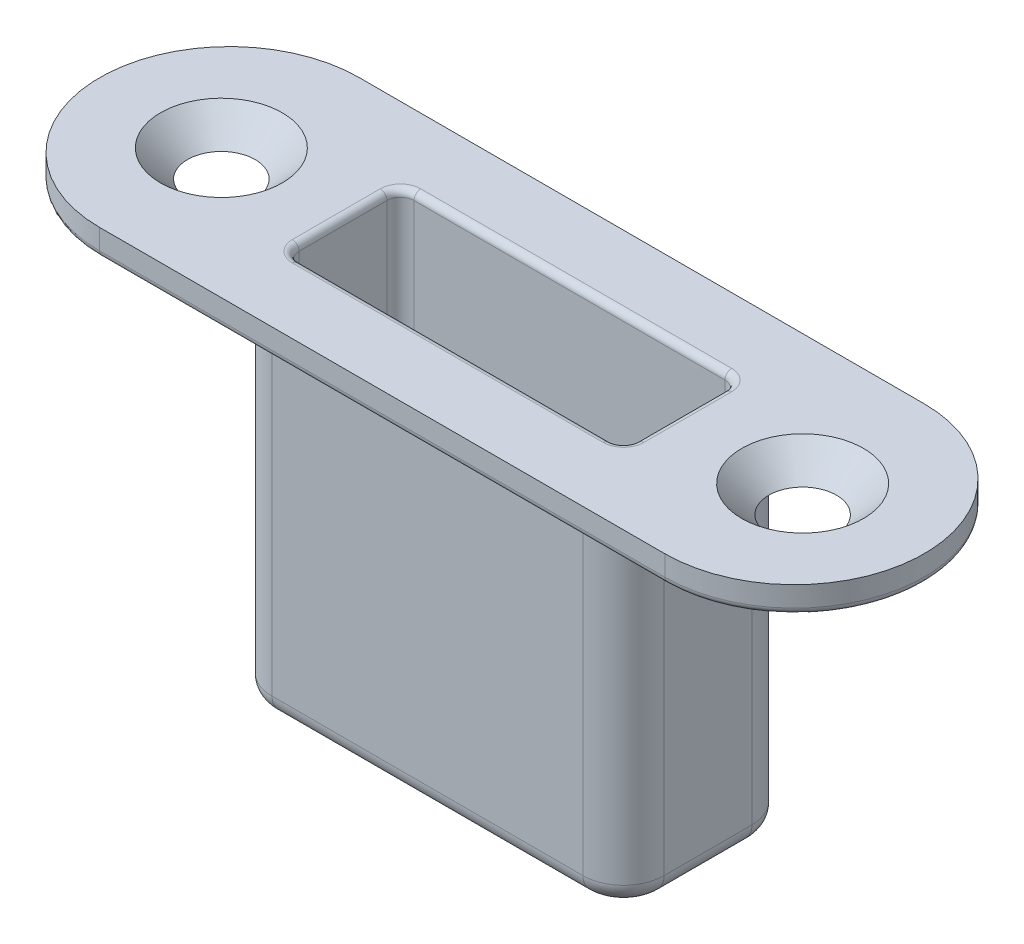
ISO-10303-21;
HEADER;
FILE_DESCRIPTION(('STEP AP214'),'2;1');
FILE_NAME('part.step','',(''),(''),'','','');
FILE_SCHEMA(('AUTOMOTIVE_DESIGN { 1 0 10303 214 1 1 1 1 }'));
ENDSEC;
DATA;
#1=APPLICATION_CONTEXT('core data for automotive mechanical design processes');
#2=APPLICATION_PROTOCOL_DEFINITION('international standard','automotive_design',2000,#1);
#3=PRODUCT_CONTEXT('',#1,'mechanical');
#4=PRODUCT('Part','Part','',(#3));
#5=PRODUCT_RELATED_PRODUCT_CATEGORY('part','',(#4));
#6=PRODUCT_DEFINITION_FORMATION('','',#4);
#7=PRODUCT_DEFINITION_CONTEXT('part definition',#1,'design');
#8=PRODUCT_DEFINITION('design','',#6,#7);
#9=PRODUCT_DEFINITION_SHAPE('','',#8);
#10=(LENGTH_UNIT() NAMED_UNIT(*) SI_UNIT(.MILLI.,.METRE.));
#11=(NAMED_UNIT(*) PLANE_ANGLE_UNIT() SI_UNIT($,.RADIAN.));
#12=(NAMED_UNIT(*) SI_UNIT($,.STERADIAN.) SOLID_ANGLE_UNIT());
#13=UNCERTAINTY_MEASURE_WITH_UNIT(LENGTH_MEASURE(1.E-05),#10,'distance_accuracy_value','');
#14=(GEOMETRIC_REPRESENTATION_CONTEXT(3) GLOBAL_UNCERTAINTY_ASSIGNED_CONTEXT((#13)) GLOBAL_UNIT_ASSIGNED_CONTEXT((#10,
#11,#12)) REPRESENTATION_CONTEXT('',''));
#15=CARTESIAN_POINT('',(0.,0.,0.));
#16=DIRECTION('',(0.,0.,1.));
#17=DIRECTION('',(1.,0.,0.));
#18=AXIS2_PLACEMENT_3D('',#15,#16,#17);
#19=CARTESIAN_POINT('',(-20.9,-2.,0.));
#20=DIRECTION('',(0.,1.,0.));
#21=DIRECTION('',(0.,0.,1.));
#22=AXIS2_PLACEMENT_3D('',#19,#20,#21);
#23=CYLINDRICAL_SURFACE('',#22,9.6);
#24=DIRECTION('',(0.,1.,0.));
#25=VECTOR('',#24,1.);
#26=CARTESIAN_POINT('',(-20.9,-2.,-9.60000000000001));
#27=LINE('',#26,#25);
#28=CARTESIAN_POINT('',(-20.9,-1.5,-9.60000000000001));
#29=VERTEX_POINT('',#28);
#30=CARTESIAN_POINT('',(-20.9,0.,-9.60000000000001));
#31=VERTEX_POINT('',#30);
#32=EDGE_CURVE('E319',#29,#31,#27,.T.);
#33=ORIENTED_EDGE('',*,*,#32,.F.);
#34=CARTESIAN_POINT('',(-20.9,-1.5,0.));
#35=DIRECTION('',(0.,1.,0.));
#36=DIRECTION('',(0.,0.,1.));
#37=AXIS2_PLACEMENT_3D('',#34,#35,#36);
#38=CIRCLE('',#37,9.6);
#39=CARTESIAN_POINT('',(-20.9,-1.5,9.6));
#40=VERTEX_POINT('',#39);
#41=EDGE_CURVE('E292',#29,#40,#38,.T.);
#42=ORIENTED_EDGE('',*,*,#41,.T.);
#43=DIRECTION('',(0.,1.,0.));
#44=VECTOR('',#43,1.);
#45=CARTESIAN_POINT('',(-20.9,-2.,9.6));
#46=LINE('',#45,#44);
#47=CARTESIAN_POINT('',(-20.9,0.,9.6));
#48=VERTEX_POINT('',#47);
#49=EDGE_CURVE('E285',#40,#48,#46,.T.);
#50=ORIENTED_EDGE('',*,*,#49,.T.);
#51=CARTESIAN_POINT('',(-20.9,0.,0.));
#52=DIRECTION('',(0.,1.,0.));
#53=DIRECTION('',(0.,0.,1.));
#54=AXIS2_PLACEMENT_3D('',#51,#52,#53);
#55=CIRCLE('',#54,9.6);
#56=EDGE_CURVE('E289',#31,#48,#55,.T.);
#57=ORIENTED_EDGE('',*,*,#56,.F.);
#58=EDGE_LOOP('',(#33,#42,#50,#57));
#59=FACE_BOUND('',#58,.T.);
#60=ADVANCED_FACE('F39',(#59),#23,.T.);
#61=CARTESIAN_POINT('',(20.9,-2.,-9.60000000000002));
#62=DIRECTION('',(0.,0.,-1.));
#63=DIRECTION('',(-1.,0.,0.));
#64=AXIS2_PLACEMENT_3D('',#61,#62,#63);
#65=PLANE('',#64);
#66=DIRECTION('',(0.,1.,0.));
#67=VECTOR('',#66,1.);
#68=CARTESIAN_POINT('',(20.9,-2.,-9.60000000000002));
#69=LINE('',#68,#67);
#70=CARTESIAN_POINT('',(20.9,-1.5,-9.60000000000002));
#71=VERTEX_POINT('',#70);
#72=CARTESIAN_POINT('',(20.9,0.,-9.60000000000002));
#73=VERTEX_POINT('',#72);
#74=EDGE_CURVE('E322',#71,#73,#69,.T.);
#75=ORIENTED_EDGE('',*,*,#74,.F.);
#76=DIRECTION('',(-1.,0.,0.));
#77=VECTOR('',#76,1.);
#78=CARTESIAN_POINT('',(-20.9,-1.5,-9.60000000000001));
#79=LINE('',#78,#77);
#80=EDGE_CURVE('E365',#71,#29,#79,.T.);
#81=ORIENTED_EDGE('',*,*,#80,.T.);
#82=ORIENTED_EDGE('',*,*,#32,.T.);
#83=DIRECTION('',(-1.,0.,0.));
#84=VECTOR('',#83,1.);
#85=CARTESIAN_POINT('',(20.9,0.,-9.60000000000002));
#86=LINE('',#85,#84);
#87=EDGE_CURVE('E296',#73,#31,#86,.T.);
#88=ORIENTED_EDGE('',*,*,#87,.F.);
#89=EDGE_LOOP('',(#75,#81,#82,#88));
#90=FACE_BOUND('',#89,.T.);
#91=ADVANCED_FACE('F665',(#90),#65,.T.);
#92=CARTESIAN_POINT('',(20.9,-2.,0.));
#93=DIRECTION('',(0.,1.,0.));
#94=DIRECTION('',(0.,0.,1.));
#95=AXIS2_PLACEMENT_3D('',#92,#93,#94);
#96=CYLINDRICAL_SURFACE('',#95,9.6);
#97=DIRECTION('',(0.,1.,0.));
#98=VECTOR('',#97,1.);
#99=CARTESIAN_POINT('',(20.9,-2.,9.6));
#100=LINE('',#99,#98);
#101=CARTESIAN_POINT('',(20.9,-1.5,9.6));
#102=VERTEX_POINT('',#101);
#103=CARTESIAN_POINT('',(20.9,0.,9.6));
#104=VERTEX_POINT('',#103);
#105=EDGE_CURVE('E295',#102,#104,#100,.T.);
#106=ORIENTED_EDGE('',*,*,#105,.F.);
#107=CARTESIAN_POINT('',(20.9,-1.5,0.));
#108=DIRECTION('',(0.,1.,0.));
#109=DIRECTION('',(0.,0.,1.));
#110=AXIS2_PLACEMENT_3D('',#107,#108,#109);
#111=CIRCLE('',#110,9.6);
#112=EDGE_CURVE('E402',#102,#71,#111,.T.);
#113=ORIENTED_EDGE('',*,*,#112,.T.);
#114=ORIENTED_EDGE('',*,*,#74,.T.);
#115=CARTESIAN_POINT('',(20.9,0.,0.));
#116=DIRECTION('',(0.,1.,0.));
#117=DIRECTION('',(0.,0.,-1.));
#118=AXIS2_PLACEMENT_3D('',#115,#116,#117);
#119=CIRCLE('',#118,9.6);
#120=EDGE_CURVE('E305',#104,#73,#119,.T.);
#121=ORIENTED_EDGE('',*,*,#120,.F.);
#122=EDGE_LOOP('',(#106,#113,#114,#121));
#123=FACE_BOUND('',#122,.T.);
#124=ADVANCED_FACE('F670',(#123),#96,.T.);
#125=CARTESIAN_POINT('',(-20.9,-2.,9.6));
#126=DIRECTION('',(0.,0.,1.));
#127=DIRECTION('',(1.,0.,0.));
#128=AXIS2_PLACEMENT_3D('',#125,#126,#127);
#129=PLANE('',#128);
#130=ORIENTED_EDGE('',*,*,#49,.F.);
#131=DIRECTION('',(1.,0.,0.));
#132=VECTOR('',#131,1.);
#133=CARTESIAN_POINT('',(20.9,-1.5,9.59999999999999));
#134=LINE('',#133,#132);
#135=EDGE_CURVE('E404',#40,#102,#134,.T.);
#136=ORIENTED_EDGE('',*,*,#135,.T.);
#137=ORIENTED_EDGE('',*,*,#105,.T.);
#138=DIRECTION('',(1.,0.,0.));
#139=VECTOR('',#138,1.);
#140=CARTESIAN_POINT('',(-20.9,0.,9.6));
#141=LINE('',#140,#139);
#142=EDGE_CURVE('E299',#48,#104,#141,.T.);
#143=ORIENTED_EDGE('',*,*,#142,.F.);
#144=EDGE_LOOP('',(#130,#136,#137,#143));
#145=FACE_BOUND('',#144,.T.);
#146=ADVANCED_FACE('F300',(#145),#129,.T.);
#147=CARTESIAN_POINT('',(-20.9,-2.,0.));
#148=DIRECTION('',(0.,1.,0.));
#149=DIRECTION('',(0.,0.,1.));
#150=AXIS2_PLACEMENT_3D('',#147,#148,#149);
#151=PLANE('',#150);
#152=CARTESIAN_POINT('',(21.5,-2.,0.));
#153=DIRECTION('',(0.,1.,0.));
#154=DIRECTION('',(0.,0.,1.));
#155=AXIS2_PLACEMENT_3D('',#152,#153,#154);
#156=CIRCLE('',#155,2.5);
#157=CARTESIAN_POINT('',(21.5,-2.,2.5));
#158=VERTEX_POINT('',#157);
#159=EDGE_CURVE('E593',#158,#158,#156,.T.);
#160=ORIENTED_EDGE('',*,*,#159,.T.);
#161=EDGE_LOOP('',(#160));
#162=FACE_BOUND('',#161,.T.);
#163=CARTESIAN_POINT('',(-21.5,-2.,0.));
#164=DIRECTION('',(0.,1.,0.));
#165=DIRECTION('',(0.,0.,1.));
#166=AXIS2_PLACEMENT_3D('',#163,#164,#165);
#167=CIRCLE('',#166,2.5);
#168=CARTESIAN_POINT('',(-21.5,-2.,2.5));
#169=VERTEX_POINT('',#168);
#170=EDGE_CURVE('E564',#169,#169,#167,.T.);
#171=ORIENTED_EDGE('',*,*,#170,.T.);
#172=EDGE_LOOP('',(#171));
#173=FACE_BOUND('',#172,.T.);
#174=CARTESIAN_POINT('',(-20.9,-2.,0.));
#175=DIRECTION('',(0.,1.,0.));
#176=DIRECTION('',(0.,0.,1.));
#177=AXIS2_PLACEMENT_3D('',#174,#175,#176);
#178=CIRCLE('',#177,9.1);
#179=CARTESIAN_POINT('',(-20.9,-2.,9.1));
#180=VERTEX_POINT('',#179);
#181=CARTESIAN_POINT('',(-20.9,-2.,-9.10000000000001));
#182=VERTEX_POINT('',#181);
#183=EDGE_CURVE('E393',#180,#182,#178,.F.);
#184=ORIENTED_EDGE('',*,*,#183,.T.);
#185=DIRECTION('',(-1.,0.,0.));
#186=VECTOR('',#185,1.);
#187=CARTESIAN_POINT('',(20.9,-2.,-9.10000000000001));
#188=LINE('',#187,#186);
#189=CARTESIAN_POINT('',(20.9,-2.,-9.1));
#190=VERTEX_POINT('',#189);
#191=EDGE_CURVE('E399',#182,#190,#188,.F.);
#192=ORIENTED_EDGE('',*,*,#191,.T.);
#193=CARTESIAN_POINT('',(20.9,-2.,0.));
#194=DIRECTION('',(0.,1.,0.));
#195=DIRECTION('',(0.,0.,1.));
#196=AXIS2_PLACEMENT_3D('',#193,#194,#195);
#197=CIRCLE('',#196,9.1);
#198=CARTESIAN_POINT('',(20.9,-2.,9.09999999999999));
#199=VERTEX_POINT('',#198);
#200=EDGE_CURVE('E397',#190,#199,#197,.F.);
#201=ORIENTED_EDGE('',*,*,#200,.T.);
#202=DIRECTION('',(1.,0.,0.));
#203=VECTOR('',#202,1.);
#204=CARTESIAN_POINT('',(-20.9,-2.,9.1));
#205=LINE('',#204,#203);
#206=EDGE_CURVE('E395',#199,#180,#205,.F.);
#207=ORIENTED_EDGE('',*,*,#206,.T.);
#208=EDGE_LOOP('',(#184,#192,#201,#207));
#209=FACE_BOUND('',#208,.T.);
#210=DIRECTION('',(0.,0.,1.));
#211=VECTOR('',#210,1.);
#212=CARTESIAN_POINT('',(-14.75,-2.,0.));
#213=LINE('',#212,#211);
#214=CARTESIAN_POINT('',(-14.75,-2.,-3.25000000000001));
#215=VERTEX_POINT('',#214);
#216=CARTESIAN_POINT('',(-14.75,-2.,3.25000000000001));
#217=VERTEX_POINT('',#216);
#218=EDGE_CURVE('E336',#215,#217,#213,.T.);
#219=ORIENTED_EDGE('',*,*,#218,.T.);
#220=CARTESIAN_POINT('',(-11.5,-2.,3.25000000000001));
#221=DIRECTION('',(0.,1.,0.));
#222=DIRECTION('',(0.,0.,1.));
#223=AXIS2_PLACEMENT_3D('',#220,#221,#222);
#224=CIRCLE('',#223,3.25);
#225=CARTESIAN_POINT('',(-11.5,-2.,6.49999999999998));
#226=VERTEX_POINT('',#225);
#227=EDGE_CURVE('E338',#217,#226,#224,.T.);
#228=ORIENTED_EDGE('',*,*,#227,.T.);
#229=DIRECTION('',(1.,0.,0.));
#230=VECTOR('',#229,1.);
#231=CARTESIAN_POINT('',(-20.9,-2.,6.49999999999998));
#232=LINE('',#231,#230);
#233=CARTESIAN_POINT('',(11.5,-2.,6.49999999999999));
#234=VERTEX_POINT('',#233);
#235=EDGE_CURVE('E321',#226,#234,#232,.T.);
#236=ORIENTED_EDGE('',*,*,#235,.T.);
#237=CARTESIAN_POINT('',(11.5,-2.,3.25000000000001));
#238=DIRECTION('',(0.,1.,0.));
#239=DIRECTION('',(0.,0.,1.));
#240=AXIS2_PLACEMENT_3D('',#237,#238,#239);
#241=CIRCLE('',#240,3.25);
#242=CARTESIAN_POINT('',(14.75,-2.,3.25000000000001));
#243=VERTEX_POINT('',#242);
#244=EDGE_CURVE('E326',#234,#243,#241,.T.);
#245=ORIENTED_EDGE('',*,*,#244,.T.);
#246=DIRECTION('',(0.,0.,-1.));
#247=VECTOR('',#246,1.);
#248=CARTESIAN_POINT('',(14.75,-2.,0.));
#249=LINE('',#248,#247);
#250=CARTESIAN_POINT('',(14.75,-2.,-3.25000000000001));
#251=VERTEX_POINT('',#250);
#252=EDGE_CURVE('E328',#243,#251,#249,.T.);
#253=ORIENTED_EDGE('',*,*,#252,.T.);
#254=CARTESIAN_POINT('',(11.5,-2.,-3.25000000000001));
#255=DIRECTION('',(0.,1.,0.));
#256=DIRECTION('',(0.,0.,1.));
#257=AXIS2_PLACEMENT_3D('',#254,#255,#256);
#258=CIRCLE('',#257,3.25);
#259=CARTESIAN_POINT('',(11.5,-2.,-6.5));
#260=VERTEX_POINT('',#259);
#261=EDGE_CURVE('E330',#251,#260,#258,.T.);
#262=ORIENTED_EDGE('',*,*,#261,.T.);
#263=DIRECTION('',(-1.,0.,0.));
#264=VECTOR('',#263,1.);
#265=CARTESIAN_POINT('',(-20.9,-2.,-6.5));
#266=LINE('',#265,#264);
#267=CARTESIAN_POINT('',(-11.5,-2.,-6.49999999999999));
#268=VERTEX_POINT('',#267);
#269=EDGE_CURVE('E332',#260,#268,#266,.T.);
#270=ORIENTED_EDGE('',*,*,#269,.T.);
#271=CARTESIAN_POINT('',(-11.5,-2.,-3.25000000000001));
#272=DIRECTION('',(0.,1.,0.));
#273=DIRECTION('',(0.,0.,1.));
#274=AXIS2_PLACEMENT_3D('',#271,#272,#273);
#275=CIRCLE('',#274,3.25);
#276=EDGE_CURVE('E334',#268,#215,#275,.T.);
#277=ORIENTED_EDGE('',*,*,#276,.T.);
#278=EDGE_LOOP('',(#219,#228,#236,#245,#253,#262,#270,#277));
#279=FACE_BOUND('',#278,.T.);
#280=ADVANCED_FACE('F824',(#162,#173,#209,#279),#151,.F.);
#281=CARTESIAN_POINT('',(-20.9,0.,0.));
#282=DIRECTION('',(0.,1.,0.));
#283=DIRECTION('',(0.,0.,1.));
#284=AXIS2_PLACEMENT_3D('',#281,#282,#283);
#285=PLANE('',#284);
#286=CARTESIAN_POINT('',(21.5,0.,0.));
#287=DIRECTION('',(0.,1.,0.));
#288=DIRECTION('',(0.,0.,1.));
#289=AXIS2_PLACEMENT_3D('',#286,#287,#288);
#290=CIRCLE('',#289,4.50000000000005);
#291=CARTESIAN_POINT('',(21.5,0.,4.50000000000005));
#292=VERTEX_POINT('',#291);
#293=EDGE_CURVE('E11',#292,#292,#290,.F.);
#294=ORIENTED_EDGE('',*,*,#293,.T.);
#295=EDGE_LOOP('',(#294));
#296=FACE_BOUND('',#295,.T.);
#297=CARTESIAN_POINT('',(-21.5,0.,0.));
#298=DIRECTION('',(0.,1.,0.));
#299=DIRECTION('',(0.,0.,1.));
#300=AXIS2_PLACEMENT_3D('',#297,#298,#299);
#301=CIRCLE('',#300,4.50000000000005);
#302=CARTESIAN_POINT('',(-21.5,0.,4.50000000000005));
#303=VERTEX_POINT('',#302);
#304=EDGE_CURVE('E47',#303,#303,#301,.F.);
#305=ORIENTED_EDGE('',*,*,#304,.T.);
#306=EDGE_LOOP('',(#305));
#307=FACE_BOUND('',#306,.T.);
#308=DIRECTION('',(-1.,0.,0.));
#309=VECTOR('',#308,1.);
#310=CARTESIAN_POINT('',(11.5,0.,-4.75));
#311=LINE('',#310,#309);
#312=CARTESIAN_POINT('',(-11.5,0.,-4.75));
#313=VERTEX_POINT('',#312);
#314=CARTESIAN_POINT('',(11.5,0.,-4.75));
#315=VERTEX_POINT('',#314);
#316=EDGE_CURVE('E411',#313,#315,#311,.F.);
#317=ORIENTED_EDGE('',*,*,#316,.T.);
#318=CARTESIAN_POINT('',(11.5,0.,-3.25000000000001));
#319=DIRECTION('',(0.,1.,0.));
#320=DIRECTION('',(0.,0.,1.));
#321=AXIS2_PLACEMENT_3D('',#318,#319,#320);
#322=CIRCLE('',#321,1.5);
#323=CARTESIAN_POINT('',(13.,0.,-3.25000000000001));
#324=VERTEX_POINT('',#323);
#325=EDGE_CURVE('E425',#315,#324,#322,.F.);
#326=ORIENTED_EDGE('',*,*,#325,.T.);
#327=DIRECTION('',(0.,0.,-1.));
#328=VECTOR('',#327,1.);
#329=CARTESIAN_POINT('',(13.,0.,3.25000000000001));
#330=LINE('',#329,#328);
#331=CARTESIAN_POINT('',(13.,0.,3.25000000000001));
#332=VERTEX_POINT('',#331);
#333=EDGE_CURVE('E423',#324,#332,#330,.F.);
#334=ORIENTED_EDGE('',*,*,#333,.T.);
#335=CARTESIAN_POINT('',(11.5,0.,3.25000000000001));
#336=DIRECTION('',(0.,1.,0.));
#337=DIRECTION('',(0.,0.,1.));
#338=AXIS2_PLACEMENT_3D('',#335,#336,#337);
#339=CIRCLE('',#338,1.49999999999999);
#340=CARTESIAN_POINT('',(11.5,0.,4.75));
#341=VERTEX_POINT('',#340);
#342=EDGE_CURVE('E421',#332,#341,#339,.F.);
#343=ORIENTED_EDGE('',*,*,#342,.T.);
#344=DIRECTION('',(1.,0.,0.));
#345=VECTOR('',#344,1.);
#346=CARTESIAN_POINT('',(-11.5,0.,4.75));
#347=LINE('',#346,#345);
#348=CARTESIAN_POINT('',(-11.5,0.,4.75000000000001));
#349=VERTEX_POINT('',#348);
#350=EDGE_CURVE('E419',#341,#349,#347,.F.);
#351=ORIENTED_EDGE('',*,*,#350,.T.);
#352=CARTESIAN_POINT('',(-11.5,0.,3.25000000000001));
#353=DIRECTION('',(0.,1.,0.));
#354=DIRECTION('',(0.,0.,1.));
#355=AXIS2_PLACEMENT_3D('',#352,#353,#354);
#356=CIRCLE('',#355,1.5);
#357=CARTESIAN_POINT('',(-13.,0.,3.25));
#358=VERTEX_POINT('',#357);
#359=EDGE_CURVE('E417',#349,#358,#356,.F.);
#360=ORIENTED_EDGE('',*,*,#359,.T.);
#361=DIRECTION('',(0.,0.,1.));
#362=VECTOR('',#361,1.);
#363=CARTESIAN_POINT('',(-13.,0.,-3.25000000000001));
#364=LINE('',#363,#362);
#365=CARTESIAN_POINT('',(-13.,0.,-3.25000000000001));
#366=VERTEX_POINT('',#365);
#367=EDGE_CURVE('E415',#358,#366,#364,.F.);
#368=ORIENTED_EDGE('',*,*,#367,.T.);
#369=CARTESIAN_POINT('',(-11.5,0.,-3.25000000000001));
#370=DIRECTION('',(0.,1.,0.));
#371=DIRECTION('',(0.,0.,1.));
#372=AXIS2_PLACEMENT_3D('',#369,#370,#371);
#373=CIRCLE('',#372,1.5);
#374=EDGE_CURVE('E413',#366,#313,#373,.F.);
#375=ORIENTED_EDGE('',*,*,#374,.T.);
#376=EDGE_LOOP('',(#317,#326,#334,#343,#351,#360,#368,#375));
#377=FACE_BOUND('',#376,.T.);
#378=ORIENTED_EDGE('',*,*,#56,.T.);
#379=ORIENTED_EDGE('',*,*,#142,.T.);
#380=ORIENTED_EDGE('',*,*,#120,.T.);
#381=ORIENTED_EDGE('',*,*,#87,.T.);
#382=EDGE_LOOP('',(#378,#379,#380,#381));
#383=FACE_BOUND('',#382,.T.);
#384=ADVANCED_FACE('F307',(#296,#307,#377,#383),#285,.T.);
#385=CARTESIAN_POINT('',(-14.5,-28.5,0.));
#386=DIRECTION('',(-1.,0.,0.));
#387=DIRECTION('',(0.,0.,1.));
#388=AXIS2_PLACEMENT_3D('',#385,#386,#387);
#389=PLANE('',#388);
#390=DIRECTION('',(0.,1.,0.));
#391=VECTOR('',#390,1.);
#392=CARTESIAN_POINT('',(-14.5,-28.5,-3.25000000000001));
#393=LINE('',#392,#391);
#394=CARTESIAN_POINT('',(-14.5,-27.,-3.25000000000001));
#395=VERTEX_POINT('',#394);
#396=CARTESIAN_POINT('',(-14.5,-2.25000000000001,-3.25000000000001));
#397=VERTEX_POINT('',#396);
#398=EDGE_CURVE('E309',#395,#397,#393,.T.);
#399=ORIENTED_EDGE('',*,*,#398,.F.);
#400=DIRECTION('',(0.,0.,1.));
#401=VECTOR('',#400,1.);
#402=CARTESIAN_POINT('',(-14.5,-27.,0.));
#403=LINE('',#402,#401);
#404=CARTESIAN_POINT('',(-14.5,-27.,3.25000000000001));
#405=VERTEX_POINT('',#404);
#406=EDGE_CURVE('E549',#395,#405,#403,.T.);
#407=ORIENTED_EDGE('',*,*,#406,.T.);
#408=DIRECTION('',(0.,1.,0.));
#409=VECTOR('',#408,1.);
#410=CARTESIAN_POINT('',(-14.5,-28.5,3.25000000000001));
#411=LINE('',#410,#409);
#412=CARTESIAN_POINT('',(-14.5,-2.25000000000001,3.25000000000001));
#413=VERTEX_POINT('',#412);
#414=EDGE_CURVE('E314',#405,#413,#411,.T.);
#415=ORIENTED_EDGE('',*,*,#414,.T.);
#416=DIRECTION('',(0.,0.,1.));
#417=VECTOR('',#416,1.);
#418=CARTESIAN_POINT('',(-14.5,-2.25,0.));
#419=LINE('',#418,#417);
#420=EDGE_CURVE('E344',#413,#397,#419,.F.);
#421=ORIENTED_EDGE('',*,*,#420,.T.);
#422=EDGE_LOOP('',(#399,#407,#415,#421));
#423=FACE_BOUND('',#422,.T.);
#424=ADVANCED_FACE('F634',(#423),#389,.T.);
#425=CARTESIAN_POINT('',(-11.5,-28.5,-3.25000000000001));
#426=DIRECTION('',(0.,1.,0.));
#427=DIRECTION('',(0.,0.,1.));
#428=AXIS2_PLACEMENT_3D('',#425,#426,#427);
#429=CYLINDRICAL_SURFACE('',#428,3.);
#430=DIRECTION('',(0.,1.,0.));
#431=VECTOR('',#430,1.);
#432=CARTESIAN_POINT('',(-11.5,-28.5,-6.25));
#433=LINE('',#432,#431);
#434=CARTESIAN_POINT('',(-11.5,-27.,-6.25));
#435=VERTEX_POINT('',#434);
#436=CARTESIAN_POINT('',(-11.5,-2.25000000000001,-6.25));
#437=VERTEX_POINT('',#436);
#438=EDGE_CURVE('E311',#435,#437,#433,.T.);
#439=ORIENTED_EDGE('',*,*,#438,.F.);
#440=CARTESIAN_POINT('',(-11.5,-27.,-3.25000000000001));
#441=DIRECTION('',(0.,-1.,0.));
#442=DIRECTION('',(0.,0.,-1.));
#443=AXIS2_PLACEMENT_3D('',#440,#441,#442);
#444=CIRCLE('',#443,3.);
#445=EDGE_CURVE('E551',#435,#395,#444,.F.);
#446=ORIENTED_EDGE('',*,*,#445,.T.);
#447=ORIENTED_EDGE('',*,*,#398,.T.);
#448=CARTESIAN_POINT('',(-11.5,-2.25,-3.25000000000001));
#449=DIRECTION('',(0.,1.,0.));
#450=DIRECTION('',(0.,0.,1.));
#451=AXIS2_PLACEMENT_3D('',#448,#449,#450);
#452=CIRCLE('',#451,3.);
#453=EDGE_CURVE('E347',#397,#437,#452,.F.);
#454=ORIENTED_EDGE('',*,*,#453,.T.);
#455=EDGE_LOOP('',(#439,#446,#447,#454));
#456=FACE_BOUND('',#455,.T.);
#457=ADVANCED_FACE('F836',(#456),#429,.T.);
#458=CARTESIAN_POINT('',(-11.5,-28.5,-6.24999999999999));
#459=DIRECTION('',(0.,0.,-1.));
#460=DIRECTION('',(-1.,0.,0.));
#461=AXIS2_PLACEMENT_3D('',#458,#459,#460);
#462=PLANE('',#461);
#463=DIRECTION('',(0.,1.,0.));
#464=VECTOR('',#463,1.);
#465=CARTESIAN_POINT('',(11.5,-28.5,-6.24999999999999));
#466=LINE('',#465,#464);
#467=CARTESIAN_POINT('',(11.5,-27.,-6.24999999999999));
#468=VERTEX_POINT('',#467);
#469=CARTESIAN_POINT('',(11.5,-2.25000000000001,-6.24999999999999));
#470=VERTEX_POINT('',#469);
#471=EDGE_CURVE('E622',#468,#470,#466,.T.);
#472=ORIENTED_EDGE('',*,*,#471,.F.);
#473=DIRECTION('',(-1.,0.,0.));
#474=VECTOR('',#473,1.);
#475=CARTESIAN_POINT('',(-11.5,-27.,-6.24999999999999));
#476=LINE('',#475,#474);
#477=EDGE_CURVE('E553',#468,#435,#476,.T.);
#478=ORIENTED_EDGE('',*,*,#477,.T.);
#479=ORIENTED_EDGE('',*,*,#438,.T.);
#480=DIRECTION('',(-1.,0.,0.));
#481=VECTOR('',#480,1.);
#482=CARTESIAN_POINT('',(-11.5,-2.25,-6.24999999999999));
#483=LINE('',#482,#481);
#484=EDGE_CURVE('E350',#437,#470,#483,.F.);
#485=ORIENTED_EDGE('',*,*,#484,.T.);
#486=EDGE_LOOP('',(#472,#478,#479,#485));
#487=FACE_BOUND('',#486,.T.);
#488=ADVANCED_FACE('F842',(#487),#462,.T.);
#489=CARTESIAN_POINT('',(11.5,-28.5,-3.25000000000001));
#490=DIRECTION('',(0.,1.,0.));
#491=DIRECTION('',(0.,0.,1.));
#492=AXIS2_PLACEMENT_3D('',#489,#490,#491);
#493=CYLINDRICAL_SURFACE('',#492,3.);
#494=DIRECTION('',(0.,1.,0.));
#495=VECTOR('',#494,1.);
#496=CARTESIAN_POINT('',(14.5,-28.5,-3.25000000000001));
#497=LINE('',#496,#495);
#498=CARTESIAN_POINT('',(14.5,-27.,-3.25000000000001));
#499=VERTEX_POINT('',#498);
#500=CARTESIAN_POINT('',(14.5,-2.25000000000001,-3.25000000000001));
#501=VERTEX_POINT('',#500);
#502=EDGE_CURVE('E624',#499,#501,#497,.T.);
#503=ORIENTED_EDGE('',*,*,#502,.F.);
#504=CARTESIAN_POINT('',(11.5,-27.,-3.25000000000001));
#505=DIRECTION('',(0.,-1.,0.));
#506=DIRECTION('',(0.,0.,-1.));
#507=AXIS2_PLACEMENT_3D('',#504,#505,#506);
#508=CIRCLE('',#507,3.);
#509=EDGE_CURVE('E555',#499,#468,#508,.F.);
#510=ORIENTED_EDGE('',*,*,#509,.T.);
#511=ORIENTED_EDGE('',*,*,#471,.T.);
#512=CARTESIAN_POINT('',(11.5,-2.25,-3.25000000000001));
#513=DIRECTION('',(0.,1.,0.));
#514=DIRECTION('',(0.,0.,1.));
#515=AXIS2_PLACEMENT_3D('',#512,#513,#514);
#516=CIRCLE('',#515,3.);
#517=EDGE_CURVE('E353',#470,#501,#516,.F.);
#518=ORIENTED_EDGE('',*,*,#517,.T.);
#519=EDGE_LOOP('',(#503,#510,#511,#518));
#520=FACE_BOUND('',#519,.T.);
#521=ADVANCED_FACE('F849',(#520),#493,.T.);
#522=CARTESIAN_POINT('',(14.5,-28.5,0.));
#523=DIRECTION('',(1.,0.,0.));
#524=DIRECTION('',(0.,0.,-1.));
#525=AXIS2_PLACEMENT_3D('',#522,#523,#524);
#526=PLANE('',#525);
#527=DIRECTION('',(0.,1.,0.));
#528=VECTOR('',#527,1.);
#529=CARTESIAN_POINT('',(14.5,-28.5,3.25000000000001));
#530=LINE('',#529,#528);
#531=CARTESIAN_POINT('',(14.5,-27.,3.25000000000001));
#532=VERTEX_POINT('',#531);
#533=CARTESIAN_POINT('',(14.5,-2.25000000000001,3.25000000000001));
#534=VERTEX_POINT('',#533);
#535=EDGE_CURVE('E626',#532,#534,#530,.T.);
#536=ORIENTED_EDGE('',*,*,#535,.F.);
#537=DIRECTION('',(0.,0.,-1.));
#538=VECTOR('',#537,1.);
#539=CARTESIAN_POINT('',(14.5,-27.,0.));
#540=LINE('',#539,#538);
#541=EDGE_CURVE('E557',#532,#499,#540,.T.);
#542=ORIENTED_EDGE('',*,*,#541,.T.);
#543=ORIENTED_EDGE('',*,*,#502,.T.);
#544=DIRECTION('',(0.,0.,-1.));
#545=VECTOR('',#544,1.);
#546=CARTESIAN_POINT('',(14.5,-2.25,0.));
#547=LINE('',#546,#545);
#548=EDGE_CURVE('E356',#501,#534,#547,.F.);
#549=ORIENTED_EDGE('',*,*,#548,.T.);
#550=EDGE_LOOP('',(#536,#542,#543,#549));
#551=FACE_BOUND('',#550,.T.);
#552=ADVANCED_FACE('F875',(#551),#526,.T.);
#553=CARTESIAN_POINT('',(11.5,-28.5,3.25000000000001));
#554=DIRECTION('',(0.,1.,0.));
#555=DIRECTION('',(0.,0.,1.));
#556=AXIS2_PLACEMENT_3D('',#553,#554,#555);
#557=CYLINDRICAL_SURFACE('',#556,3.);
#558=DIRECTION('',(0.,1.,0.));
#559=VECTOR('',#558,1.);
#560=CARTESIAN_POINT('',(11.5,-28.5,6.25));
#561=LINE('',#560,#559);
#562=CARTESIAN_POINT('',(11.5,-27.,6.25));
#563=VERTEX_POINT('',#562);
#564=CARTESIAN_POINT('',(11.5,-2.25000000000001,6.25));
#565=VERTEX_POINT('',#564);
#566=EDGE_CURVE('E628',#563,#565,#561,.T.);
#567=ORIENTED_EDGE('',*,*,#566,.F.);
#568=CARTESIAN_POINT('',(11.5,-27.,3.25000000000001));
#569=DIRECTION('',(0.,-1.,0.));
#570=DIRECTION('',(0.,0.,-1.));
#571=AXIS2_PLACEMENT_3D('',#568,#569,#570);
#572=CIRCLE('',#571,3.);
#573=EDGE_CURVE('E61',#563,#532,#572,.F.);
#574=ORIENTED_EDGE('',*,*,#573,.T.);
#575=ORIENTED_EDGE('',*,*,#535,.T.);
#576=CARTESIAN_POINT('',(11.5,-2.25,3.25000000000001));
#577=DIRECTION('',(0.,1.,0.));
#578=DIRECTION('',(0.,0.,1.));
#579=AXIS2_PLACEMENT_3D('',#576,#577,#578);
#580=CIRCLE('',#579,3.);
#581=EDGE_CURVE('E359',#534,#565,#580,.F.);
#582=ORIENTED_EDGE('',*,*,#581,.T.);
#583=EDGE_LOOP('',(#567,#574,#575,#582));
#584=FACE_BOUND('',#583,.T.);
#585=ADVANCED_FACE('F661',(#584),#557,.T.);
#586=CARTESIAN_POINT('',(11.5,-28.5,6.24999999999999));
#587=DIRECTION('',(0.,0.,1.));
#588=DIRECTION('',(1.,0.,0.));
#589=AXIS2_PLACEMENT_3D('',#586,#587,#588);
#590=PLANE('',#589);
#591=DIRECTION('',(0.,1.,0.));
#592=VECTOR('',#591,1.);
#593=CARTESIAN_POINT('',(-11.5,-28.5,6.24999999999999));
#594=LINE('',#593,#592);
#595=CARTESIAN_POINT('',(-11.5,-27.,6.24999999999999));
#596=VERTEX_POINT('',#595);
#597=CARTESIAN_POINT('',(-11.5,-2.25000000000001,6.24999999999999));
#598=VERTEX_POINT('',#597);
#599=EDGE_CURVE('E629',#596,#598,#594,.T.);
#600=ORIENTED_EDGE('',*,*,#599,.F.);
#601=DIRECTION('',(1.,0.,0.));
#602=VECTOR('',#601,1.);
#603=CARTESIAN_POINT('',(11.5,-27.,6.24999999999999));
#604=LINE('',#603,#602);
#605=EDGE_CURVE('E54',#596,#563,#604,.T.);
#606=ORIENTED_EDGE('',*,*,#605,.T.);
#607=ORIENTED_EDGE('',*,*,#566,.T.);
#608=DIRECTION('',(1.,0.,0.));
#609=VECTOR('',#608,1.);
#610=CARTESIAN_POINT('',(11.5,-2.25,6.24999999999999));
#611=LINE('',#610,#609);
#612=EDGE_CURVE('E362',#565,#598,#611,.F.);
#613=ORIENTED_EDGE('',*,*,#612,.T.);
#614=EDGE_LOOP('',(#600,#606,#607,#613));
#615=FACE_BOUND('',#614,.T.);
#616=ADVANCED_FACE('F652',(#615),#590,.T.);
#617=CARTESIAN_POINT('',(-11.5,-28.5,3.25000000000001));
#618=DIRECTION('',(0.,1.,0.));
#619=DIRECTION('',(0.,0.,1.));
#620=AXIS2_PLACEMENT_3D('',#617,#618,#619);
#621=CYLINDRICAL_SURFACE('',#620,3.);
#622=ORIENTED_EDGE('',*,*,#414,.F.);
#623=CARTESIAN_POINT('',(-11.5,-27.,3.25000000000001));
#624=DIRECTION('',(0.,-1.,0.));
#625=DIRECTION('',(0.,0.,-1.));
#626=AXIS2_PLACEMENT_3D('',#623,#624,#625);
#627=CIRCLE('',#626,3.);
#628=EDGE_CURVE('E475',#405,#596,#627,.F.);
#629=ORIENTED_EDGE('',*,*,#628,.T.);
#630=ORIENTED_EDGE('',*,*,#599,.T.);
#631=CARTESIAN_POINT('',(-11.5,-2.25,3.25000000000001));
#632=DIRECTION('',(0.,1.,0.));
#633=DIRECTION('',(0.,0.,1.));
#634=AXIS2_PLACEMENT_3D('',#631,#632,#633);
#635=CIRCLE('',#634,3.);
#636=EDGE_CURVE('E341',#598,#413,#635,.F.);
#637=ORIENTED_EDGE('',*,*,#636,.T.);
#638=EDGE_LOOP('',(#622,#629,#630,#637));
#639=FACE_BOUND('',#638,.T.);
#640=ADVANCED_FACE('F649',(#639),#621,.T.);
#641=CARTESIAN_POINT('',(-11.5,-28.5,3.25000000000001));
#642=DIRECTION('',(0.,-1.,0.));
#643=DIRECTION('',(0.,0.,-1.));
#644=AXIS2_PLACEMENT_3D('',#641,#642,#643);
#645=PLANE('',#644);
#646=DIRECTION('',(1.,0.,0.));
#647=VECTOR('',#646,1.);
#648=CARTESIAN_POINT('',(-11.5,-28.5,4.74999999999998));
#649=LINE('',#648,#647);
#650=CARTESIAN_POINT('',(11.5,-28.5,4.74999999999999));
#651=VERTEX_POINT('',#650);
#652=CARTESIAN_POINT('',(-11.5,-28.5,4.74999999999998));
#653=VERTEX_POINT('',#652);
#654=EDGE_CURVE('E532',#651,#653,#649,.F.);
#655=ORIENTED_EDGE('',*,*,#654,.T.);
#656=CARTESIAN_POINT('',(-11.5,-28.5,3.25000000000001));
#657=DIRECTION('',(0.,-1.,0.));
#658=DIRECTION('',(0.,0.,-1.));
#659=AXIS2_PLACEMENT_3D('',#656,#657,#658);
#660=CIRCLE('',#659,1.5);
#661=CARTESIAN_POINT('',(-13.,-28.5,3.25000000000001));
#662=VERTEX_POINT('',#661);
#663=EDGE_CURVE('E546',#653,#662,#660,.T.);
#664=ORIENTED_EDGE('',*,*,#663,.T.);
#665=DIRECTION('',(0.,0.,1.));
#666=VECTOR('',#665,1.);
#667=CARTESIAN_POINT('',(-13.,-28.5,3.25000000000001));
#668=LINE('',#667,#666);
#669=CARTESIAN_POINT('',(-13.,-28.5,-3.25000000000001));
#670=VERTEX_POINT('',#669);
#671=EDGE_CURVE('E544',#662,#670,#668,.F.);
#672=ORIENTED_EDGE('',*,*,#671,.T.);
#673=CARTESIAN_POINT('',(-11.5,-28.5,-3.25000000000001));
#674=DIRECTION('',(0.,-1.,0.));
#675=DIRECTION('',(0.,0.,-1.));
#676=AXIS2_PLACEMENT_3D('',#673,#674,#675);
#677=CIRCLE('',#676,1.5);
#678=CARTESIAN_POINT('',(-11.5,-28.5,-4.74999999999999));
#679=VERTEX_POINT('',#678);
#680=EDGE_CURVE('E542',#670,#679,#677,.T.);
#681=ORIENTED_EDGE('',*,*,#680,.T.);
#682=DIRECTION('',(-1.,0.,0.));
#683=VECTOR('',#682,1.);
#684=CARTESIAN_POINT('',(-11.5,-28.5,-4.74999999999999));
#685=LINE('',#684,#683);
#686=CARTESIAN_POINT('',(11.5,-28.5,-4.75));
#687=VERTEX_POINT('',#686);
#688=EDGE_CURVE('E540',#679,#687,#685,.F.);
#689=ORIENTED_EDGE('',*,*,#688,.T.);
#690=CARTESIAN_POINT('',(11.5,-28.5,-3.25000000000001));
#691=DIRECTION('',(0.,-1.,0.));
#692=DIRECTION('',(0.,0.,-1.));
#693=AXIS2_PLACEMENT_3D('',#690,#691,#692);
#694=CIRCLE('',#693,1.5);
#695=CARTESIAN_POINT('',(13.,-28.5,-3.25000000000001));
#696=VERTEX_POINT('',#695);
#697=EDGE_CURVE('E538',#687,#696,#694,.T.);
#698=ORIENTED_EDGE('',*,*,#697,.T.);
#699=DIRECTION('',(0.,0.,-1.));
#700=VECTOR('',#699,1.);
#701=CARTESIAN_POINT('',(13.,-28.5,3.25000000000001));
#702=LINE('',#701,#700);
#703=CARTESIAN_POINT('',(13.,-28.5,3.25000000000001));
#704=VERTEX_POINT('',#703);
#705=EDGE_CURVE('E536',#696,#704,#702,.F.);
#706=ORIENTED_EDGE('',*,*,#705,.T.);
#707=CARTESIAN_POINT('',(11.5,-28.5,3.25000000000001));
#708=DIRECTION('',(0.,-1.,0.));
#709=DIRECTION('',(0.,0.,-1.));
#710=AXIS2_PLACEMENT_3D('',#707,#708,#709);
#711=CIRCLE('',#710,1.5);
#712=EDGE_CURVE('E534',#704,#651,#711,.T.);
#713=ORIENTED_EDGE('',*,*,#712,.T.);
#714=EDGE_LOOP('',(#655,#664,#672,#681,#689,#698,#706,#713));
#715=FACE_BOUND('',#714,.T.);
#716=ADVANCED_FACE('F651',(#715),#645,.T.);
#717=CARTESIAN_POINT('',(-11.5,-26.5,-3.25000000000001));
#718=DIRECTION('',(0.,1.,0.));
#719=DIRECTION('',(0.,0.,1.));
#720=AXIS2_PLACEMENT_3D('',#717,#718,#719);
#721=CYLINDRICAL_SURFACE('',#720,0.999999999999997);
#722=DIRECTION('',(0.,1.,0.));
#723=VECTOR('',#722,1.);
#724=CARTESIAN_POINT('',(-11.5,-26.5,-4.25));
#725=LINE('',#724,#723);
#726=CARTESIAN_POINT('',(-11.5,-26.,-4.25));
#727=VERTEX_POINT('',#726);
#728=CARTESIAN_POINT('',(-11.5,-0.5,-4.25));
#729=VERTEX_POINT('',#728);
#730=EDGE_CURVE('E598',#727,#729,#725,.T.);
#731=ORIENTED_EDGE('',*,*,#730,.T.);
#732=CARTESIAN_POINT('',(-11.5,-0.5,-3.25000000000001));
#733=DIRECTION('',(0.,1.,0.));
#734=DIRECTION('',(0.,0.,1.));
#735=AXIS2_PLACEMENT_3D('',#732,#733,#734);
#736=CIRCLE('',#735,0.999999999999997);
#737=CARTESIAN_POINT('',(-12.5,-0.5,-3.25000000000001));
#738=VERTEX_POINT('',#737);
#739=EDGE_CURVE('E450',#729,#738,#736,.T.);
#740=ORIENTED_EDGE('',*,*,#739,.T.);
#741=DIRECTION('',(0.,1.,0.));
#742=VECTOR('',#741,1.);
#743=CARTESIAN_POINT('',(-12.5,-26.5,-3.25000000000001));
#744=LINE('',#743,#742);
#745=CARTESIAN_POINT('',(-12.5,-26.,-3.25000000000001));
#746=VERTEX_POINT('',#745);
#747=EDGE_CURVE('E390',#746,#738,#744,.T.);
#748=ORIENTED_EDGE('',*,*,#747,.F.);
#749=CARTESIAN_POINT('',(-11.5,-26.,-3.25000000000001));
#750=DIRECTION('',(0.,1.,0.));
#751=DIRECTION('',(0.,0.,1.));
#752=AXIS2_PLACEMENT_3D('',#749,#750,#751);
#753=CIRCLE('',#752,0.999999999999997);
#754=EDGE_CURVE('E448',#746,#727,#753,.F.);
#755=ORIENTED_EDGE('',*,*,#754,.T.);
#756=EDGE_LOOP('',(#731,#740,#748,#755));
#757=FACE_BOUND('',#756,.T.);
#758=ADVANCED_FACE('F658',(#757),#721,.F.);
#759=CARTESIAN_POINT('',(-8.25,-26.5,-4.25));
#760=DIRECTION('',(0.,0.,-1.));
#761=DIRECTION('',(-1.,0.,0.));
#762=AXIS2_PLACEMENT_3D('',#759,#760,#761);
#763=PLANE('',#762);
#764=ORIENTED_EDGE('',*,*,#730,.F.);
#765=DIRECTION('',(-1.,0.,0.));
#766=VECTOR('',#765,1.);
#767=CARTESIAN_POINT('',(-8.25,-26.,-4.25));
#768=LINE('',#767,#766);
#769=CARTESIAN_POINT('',(11.5,-26.,-4.25000000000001));
#770=VERTEX_POINT('',#769);
#771=EDGE_CURVE('E471',#727,#770,#768,.F.);
#772=ORIENTED_EDGE('',*,*,#771,.T.);
#773=DIRECTION('',(0.,1.,0.));
#774=VECTOR('',#773,1.);
#775=CARTESIAN_POINT('',(11.5,-26.5,-4.25000000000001));
#776=LINE('',#775,#774);
#777=CARTESIAN_POINT('',(11.5,-0.5,-4.25000000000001));
#778=VERTEX_POINT('',#777);
#779=EDGE_CURVE('E601',#770,#778,#776,.T.);
#780=ORIENTED_EDGE('',*,*,#779,.T.);
#781=DIRECTION('',(-1.,0.,0.));
#782=VECTOR('',#781,1.);
#783=CARTESIAN_POINT('',(-11.5,-0.5,-4.25));
#784=LINE('',#783,#782);
#785=EDGE_CURVE('E469',#778,#729,#784,.T.);
#786=ORIENTED_EDGE('',*,*,#785,.T.);
#787=EDGE_LOOP('',(#764,#772,#780,#786));
#788=FACE_BOUND('',#787,.T.);
#789=ADVANCED_FACE('F894',(#788),#763,.F.);
#790=CARTESIAN_POINT('',(11.5,-26.5,-3.25000000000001));
#791=DIRECTION('',(0.,1.,0.));
#792=DIRECTION('',(0.,0.,1.));
#793=AXIS2_PLACEMENT_3D('',#790,#791,#792);
#794=CYLINDRICAL_SURFACE('',#793,1.);
#795=DIRECTION('',(0.,1.,0.));
#796=VECTOR('',#795,1.);
#797=CARTESIAN_POINT('',(12.5,-26.5,-3.25000000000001));
#798=LINE('',#797,#796);
#799=CARTESIAN_POINT('',(12.5,-26.,-3.25000000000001));
#800=VERTEX_POINT('',#799);
#801=CARTESIAN_POINT('',(12.5,-0.5,-3.25000000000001));
#802=VERTEX_POINT('',#801);
#803=EDGE_CURVE('E604',#800,#802,#798,.T.);
#804=ORIENTED_EDGE('',*,*,#803,.T.);
#805=CARTESIAN_POINT('',(11.5,-0.5,-3.25000000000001));
#806=DIRECTION('',(0.,1.,0.));
#807=DIRECTION('',(0.,0.,1.));
#808=AXIS2_PLACEMENT_3D('',#805,#806,#807);
#809=CIRCLE('',#808,1.);
#810=EDGE_CURVE('E408',#802,#778,#809,.T.);
#811=ORIENTED_EDGE('',*,*,#810,.T.);
#812=ORIENTED_EDGE('',*,*,#779,.F.);
#813=CARTESIAN_POINT('',(11.5,-26.,-3.25000000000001));
#814=DIRECTION('',(0.,1.,0.));
#815=DIRECTION('',(0.,0.,1.));
#816=AXIS2_PLACEMENT_3D('',#813,#814,#815);
#817=CIRCLE('',#816,1.);
#818=EDGE_CURVE('E406',#770,#800,#817,.F.);
#819=ORIENTED_EDGE('',*,*,#818,.T.);
#820=EDGE_LOOP('',(#804,#811,#812,#819));
#821=FACE_BOUND('',#820,.T.);
#822=ADVANCED_FACE('F915',(#821),#794,.F.);
#823=CARTESIAN_POINT('',(12.5,-26.5,0.));
#824=DIRECTION('',(1.,0.,0.));
#825=DIRECTION('',(0.,0.,-1.));
#826=AXIS2_PLACEMENT_3D('',#823,#824,#825);
#827=PLANE('',#826);
#828=DIRECTION('',(0.,1.,0.));
#829=VECTOR('',#828,1.);
#830=CARTESIAN_POINT('',(12.5,-26.5,3.25000000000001));
#831=LINE('',#830,#829);
#832=CARTESIAN_POINT('',(12.5,-26.,3.25000000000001));
#833=VERTEX_POINT('',#832);
#834=CARTESIAN_POINT('',(12.5,-0.5,3.25000000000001));
#835=VERTEX_POINT('',#834);
#836=EDGE_CURVE('E607',#833,#835,#831,.T.);
#837=ORIENTED_EDGE('',*,*,#836,.T.);
#838=DIRECTION('',(0.,0.,-1.));
#839=VECTOR('',#838,1.);
#840=CARTESIAN_POINT('',(12.5,-0.5,-3.25000000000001));
#841=LINE('',#840,#839);
#842=EDGE_CURVE('E430',#835,#802,#841,.T.);
#843=ORIENTED_EDGE('',*,*,#842,.T.);
#844=ORIENTED_EDGE('',*,*,#803,.F.);
#845=DIRECTION('',(0.,0.,-1.));
#846=VECTOR('',#845,1.);
#847=CARTESIAN_POINT('',(12.5,-26.,0.));
#848=LINE('',#847,#846);
#849=EDGE_CURVE('E428',#800,#833,#848,.F.);
#850=ORIENTED_EDGE('',*,*,#849,.T.);
#851=EDGE_LOOP('',(#837,#843,#844,#850));
#852=FACE_BOUND('',#851,.T.);
#853=ADVANCED_FACE('F911',(#852),#827,.F.);
#854=CARTESIAN_POINT('',(11.5,-26.5,3.25000000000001));
#855=DIRECTION('',(0.,1.,0.));
#856=DIRECTION('',(0.,0.,1.));
#857=AXIS2_PLACEMENT_3D('',#854,#855,#856);
#858=CYLINDRICAL_SURFACE('',#857,0.999999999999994);
#859=DIRECTION('',(0.,1.,0.));
#860=VECTOR('',#859,1.);
#861=CARTESIAN_POINT('',(11.5,-26.5,4.25));
#862=LINE('',#861,#860);
#863=CARTESIAN_POINT('',(11.5,-26.,4.25));
#864=VERTEX_POINT('',#863);
#865=CARTESIAN_POINT('',(11.5,-0.5,4.25));
#866=VERTEX_POINT('',#865);
#867=EDGE_CURVE('E610',#864,#866,#862,.T.);
#868=ORIENTED_EDGE('',*,*,#867,.T.);
#869=CARTESIAN_POINT('',(11.5,-0.5,3.25000000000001));
#870=DIRECTION('',(0.,1.,0.));
#871=DIRECTION('',(0.,0.,1.));
#872=AXIS2_PLACEMENT_3D('',#869,#870,#871);
#873=CIRCLE('',#872,0.999999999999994);
#874=EDGE_CURVE('E434',#866,#835,#873,.T.);
#875=ORIENTED_EDGE('',*,*,#874,.T.);
#876=ORIENTED_EDGE('',*,*,#836,.F.);
#877=CARTESIAN_POINT('',(11.5,-26.,3.25000000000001));
#878=DIRECTION('',(0.,1.,0.));
#879=DIRECTION('',(0.,0.,1.));
#880=AXIS2_PLACEMENT_3D('',#877,#878,#879);
#881=CIRCLE('',#880,0.999999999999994);
#882=EDGE_CURVE('E432',#833,#864,#881,.F.);
#883=ORIENTED_EDGE('',*,*,#882,.T.);
#884=EDGE_LOOP('',(#868,#875,#876,#883));
#885=FACE_BOUND('',#884,.T.);
#886=ADVANCED_FACE('F907',(#885),#858,.F.);
#887=CARTESIAN_POINT('',(8.25,-26.5,4.25));
#888=DIRECTION('',(0.,0.,1.));
#889=DIRECTION('',(1.,0.,0.));
#890=AXIS2_PLACEMENT_3D('',#887,#888,#889);
#891=PLANE('',#890);
#892=DIRECTION('',(0.,1.,0.));
#893=VECTOR('',#892,1.);
#894=CARTESIAN_POINT('',(-11.5,-26.5,4.25000000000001));
#895=LINE('',#894,#893);
#896=CARTESIAN_POINT('',(-11.5,-26.,4.25000000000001));
#897=VERTEX_POINT('',#896);
#898=CARTESIAN_POINT('',(-11.5,-0.5,4.25000000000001));
#899=VERTEX_POINT('',#898);
#900=EDGE_CURVE('E613',#897,#899,#895,.T.);
#901=ORIENTED_EDGE('',*,*,#900,.T.);
#902=DIRECTION('',(1.,0.,0.));
#903=VECTOR('',#902,1.);
#904=CARTESIAN_POINT('',(11.5,-0.5,4.25));
#905=LINE('',#904,#903);
#906=EDGE_CURVE('E438',#899,#866,#905,.T.);
#907=ORIENTED_EDGE('',*,*,#906,.T.);
#908=ORIENTED_EDGE('',*,*,#867,.F.);
#909=DIRECTION('',(1.,0.,0.));
#910=VECTOR('',#909,1.);
#911=CARTESIAN_POINT('',(8.25,-26.,4.25));
#912=LINE('',#911,#910);
#913=EDGE_CURVE('E436',#864,#897,#912,.F.);
#914=ORIENTED_EDGE('',*,*,#913,.T.);
#915=EDGE_LOOP('',(#901,#907,#908,#914));
#916=FACE_BOUND('',#915,.T.);
#917=ADVANCED_FACE('F903',(#916),#891,.F.);
#918=CARTESIAN_POINT('',(-11.5,-26.5,3.25000000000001));
#919=DIRECTION('',(0.,1.,0.));
#920=DIRECTION('',(0.,0.,1.));
#921=AXIS2_PLACEMENT_3D('',#918,#919,#920);
#922=CYLINDRICAL_SURFACE('',#921,1.);
#923=DIRECTION('',(0.,1.,0.));
#924=VECTOR('',#923,1.);
#925=CARTESIAN_POINT('',(-12.5,-26.5,3.25));
#926=LINE('',#925,#924);
#927=CARTESIAN_POINT('',(-12.5,-26.,3.25));
#928=VERTEX_POINT('',#927);
#929=CARTESIAN_POINT('',(-12.5,-0.5,3.25));
#930=VERTEX_POINT('',#929);
#931=EDGE_CURVE('E616',#928,#930,#926,.T.);
#932=ORIENTED_EDGE('',*,*,#931,.T.);
#933=CARTESIAN_POINT('',(-11.5,-0.5,3.25000000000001));
#934=DIRECTION('',(0.,1.,0.));
#935=DIRECTION('',(0.,0.,1.));
#936=AXIS2_PLACEMENT_3D('',#933,#934,#935);
#937=CIRCLE('',#936,1.);
#938=EDGE_CURVE('E442',#930,#899,#937,.T.);
#939=ORIENTED_EDGE('',*,*,#938,.T.);
#940=ORIENTED_EDGE('',*,*,#900,.F.);
#941=CARTESIAN_POINT('',(-11.5,-26.,3.25000000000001));
#942=DIRECTION('',(0.,1.,0.));
#943=DIRECTION('',(0.,0.,1.));
#944=AXIS2_PLACEMENT_3D('',#941,#942,#943);
#945=CIRCLE('',#944,1.);
#946=EDGE_CURVE('E440',#897,#928,#945,.F.);
#947=ORIENTED_EDGE('',*,*,#946,.T.);
#948=EDGE_LOOP('',(#932,#939,#940,#947));
#949=FACE_BOUND('',#948,.T.);
#950=ADVANCED_FACE('F899',(#949),#922,.F.);
#951=CARTESIAN_POINT('',(-12.5,-26.5,0.));
#952=DIRECTION('',(-1.,0.,0.));
#953=DIRECTION('',(0.,0.,1.));
#954=AXIS2_PLACEMENT_3D('',#951,#952,#953);
#955=PLANE('',#954);
#956=ORIENTED_EDGE('',*,*,#747,.T.);
#957=DIRECTION('',(0.,0.,1.));
#958=VECTOR('',#957,1.);
#959=CARTESIAN_POINT('',(-12.5,-0.5,3.25));
#960=LINE('',#959,#958);
#961=EDGE_CURVE('E446',#738,#930,#960,.T.);
#962=ORIENTED_EDGE('',*,*,#961,.T.);
#963=ORIENTED_EDGE('',*,*,#931,.F.);
#964=DIRECTION('',(0.,0.,1.));
#965=VECTOR('',#964,1.);
#966=CARTESIAN_POINT('',(-12.5,-26.,0.));
#967=LINE('',#966,#965);
#968=EDGE_CURVE('E444',#928,#746,#967,.F.);
#969=ORIENTED_EDGE('',*,*,#968,.T.);
#970=EDGE_LOOP('',(#956,#962,#963,#969));
#971=FACE_BOUND('',#970,.T.);
#972=ADVANCED_FACE('F896',(#971),#955,.F.);
#973=CARTESIAN_POINT('',(-11.5,-26.5,-3.25000000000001));
#974=DIRECTION('',(0.,1.,0.));
#975=DIRECTION('',(0.,0.,1.));
#976=AXIS2_PLACEMENT_3D('',#973,#974,#975);
#977=PLANE('',#976);
#978=CARTESIAN_POINT('',(11.5,-26.5,-3.25000000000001));
#979=DIRECTION('',(0.,1.,0.));
#980=DIRECTION('',(0.,0.,1.));
#981=AXIS2_PLACEMENT_3D('',#978,#979,#980);
#982=CIRCLE('',#981,0.5);
#983=CARTESIAN_POINT('',(12.,-26.5,-3.25000000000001));
#984=VERTEX_POINT('',#983);
#985=CARTESIAN_POINT('',(11.5,-26.5,-3.75000000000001));
#986=VERTEX_POINT('',#985);
#987=EDGE_CURVE('E464',#984,#986,#982,.T.);
#988=ORIENTED_EDGE('',*,*,#987,.T.);
#989=DIRECTION('',(-1.,0.,0.));
#990=VECTOR('',#989,1.);
#991=CARTESIAN_POINT('',(-11.5,-26.5,-3.75));
#992=LINE('',#991,#990);
#993=CARTESIAN_POINT('',(-11.5,-26.5,-3.75));
#994=VERTEX_POINT('',#993);
#995=EDGE_CURVE('E466',#986,#994,#992,.T.);
#996=ORIENTED_EDGE('',*,*,#995,.T.);
#997=CARTESIAN_POINT('',(-11.5,-26.5,-3.25000000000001));
#998=DIRECTION('',(0.,1.,0.));
#999=DIRECTION('',(0.,0.,1.));
#1000=AXIS2_PLACEMENT_3D('',#997,#998,#999);
#1001=CIRCLE('',#1000,0.499999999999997);
#1002=CARTESIAN_POINT('',(-12.,-26.5,-3.25000000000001));
#1003=VERTEX_POINT('',#1002);
#1004=EDGE_CURVE('E452',#994,#1003,#1001,.T.);
#1005=ORIENTED_EDGE('',*,*,#1004,.T.);
#1006=DIRECTION('',(0.,0.,1.));
#1007=VECTOR('',#1006,1.);
#1008=CARTESIAN_POINT('',(-12.,-26.5,-3.25000000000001));
#1009=LINE('',#1008,#1007);
#1010=CARTESIAN_POINT('',(-12.,-26.5,3.25));
#1011=VERTEX_POINT('',#1010);
#1012=EDGE_CURVE('E454',#1003,#1011,#1009,.T.);
#1013=ORIENTED_EDGE('',*,*,#1012,.T.);
#1014=CARTESIAN_POINT('',(-11.5,-26.5,3.25000000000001));
#1015=DIRECTION('',(0.,1.,0.));
#1016=DIRECTION('',(0.,0.,1.));
#1017=AXIS2_PLACEMENT_3D('',#1014,#1015,#1016);
#1018=CIRCLE('',#1017,0.5);
#1019=CARTESIAN_POINT('',(-11.5,-26.5,3.75000000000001));
#1020=VERTEX_POINT('',#1019);
#1021=EDGE_CURVE('E456',#1011,#1020,#1018,.T.);
#1022=ORIENTED_EDGE('',*,*,#1021,.T.);
#1023=DIRECTION('',(1.,0.,0.));
#1024=VECTOR('',#1023,1.);
#1025=CARTESIAN_POINT('',(-11.5,-26.5,3.75));
#1026=LINE('',#1025,#1024);
#1027=CARTESIAN_POINT('',(11.5,-26.5,3.75));
#1028=VERTEX_POINT('',#1027);
#1029=EDGE_CURVE('E458',#1020,#1028,#1026,.T.);
#1030=ORIENTED_EDGE('',*,*,#1029,.T.);
#1031=CARTESIAN_POINT('',(11.5,-26.5,3.25000000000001));
#1032=DIRECTION('',(0.,1.,0.));
#1033=DIRECTION('',(0.,0.,1.));
#1034=AXIS2_PLACEMENT_3D('',#1031,#1032,#1033);
#1035=CIRCLE('',#1034,0.499999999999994);
#1036=CARTESIAN_POINT('',(12.,-26.5,3.25));
#1037=VERTEX_POINT('',#1036);
#1038=EDGE_CURVE('E460',#1028,#1037,#1035,.T.);
#1039=ORIENTED_EDGE('',*,*,#1038,.T.);
#1040=DIRECTION('',(0.,0.,-1.));
#1041=VECTOR('',#1040,1.);
#1042=CARTESIAN_POINT('',(12.,-26.5,-3.24999999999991));
#1043=LINE('',#1042,#1041);
#1044=EDGE_CURVE('E462',#1037,#984,#1043,.T.);
#1045=ORIENTED_EDGE('',*,*,#1044,.T.);
#1046=EDGE_LOOP('',(#988,#996,#1005,#1013,#1022,#1030,#1039,#1045));
#1047=FACE_BOUND('',#1046,.T.);
#1048=ADVANCED_FACE('F704',(#1047),#977,.T.);
#1049=CARTESIAN_POINT('',(11.5,-2.25,-3.25000000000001));
#1050=DIRECTION('',(0.,1.,0.));
#1051=DIRECTION('',(0.,0.,1.));
#1052=AXIS2_PLACEMENT_3D('',#1049,#1050,#1051);
#1053=TOROIDAL_SURFACE('',#1052,3.25,0.25);
#1054=CARTESIAN_POINT('',(14.75,-2.25,-3.25000000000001));
#1055=DIRECTION('',(0.,0.,-1.));
#1056=DIRECTION('',(-1.,0.,0.));
#1057=AXIS2_PLACEMENT_3D('',#1054,#1055,#1056);
#1058=CIRCLE('',#1057,0.25);
#1059=EDGE_CURVE('E384',#501,#251,#1058,.T.);
#1060=ORIENTED_EDGE('',*,*,#1059,.F.);
#1061=ORIENTED_EDGE('',*,*,#517,.F.);
#1062=CARTESIAN_POINT('',(11.5,-2.25,-6.5));
#1063=DIRECTION('',(1.,0.,0.));
#1064=DIRECTION('',(0.,0.,-1.));
#1065=AXIS2_PLACEMENT_3D('',#1062,#1063,#1064);
#1066=CIRCLE('',#1065,0.25);
#1067=EDGE_CURVE('E387',#260,#470,#1066,.T.);
#1068=ORIENTED_EDGE('',*,*,#1067,.F.);
#1069=ORIENTED_EDGE('',*,*,#261,.F.);
#1070=EDGE_LOOP('',(#1060,#1061,#1068,#1069));
#1071=FACE_BOUND('',#1070,.T.);
#1072=ADVANCED_FACE('F700',(#1071),#1053,.F.);
#1073=CARTESIAN_POINT('',(-20.9,-2.25,-6.5));
#1074=DIRECTION('',(-1.,0.,0.));
#1075=DIRECTION('',(0.,0.,1.));
#1076=AXIS2_PLACEMENT_3D('',#1073,#1074,#1075);
#1077=CYLINDRICAL_SURFACE('',#1076,0.25);
#1078=ORIENTED_EDGE('',*,*,#1067,.T.);
#1079=ORIENTED_EDGE('',*,*,#484,.F.);
#1080=CARTESIAN_POINT('',(-11.5,-2.25,-6.49999999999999));
#1081=DIRECTION('',(1.,0.,0.));
#1082=DIRECTION('',(0.,0.,-1.));
#1083=AXIS2_PLACEMENT_3D('',#1080,#1081,#1082);
#1084=CIRCLE('',#1083,0.25);
#1085=EDGE_CURVE('E381',#268,#437,#1084,.T.);
#1086=ORIENTED_EDGE('',*,*,#1085,.F.);
#1087=ORIENTED_EDGE('',*,*,#269,.F.);
#1088=EDGE_LOOP('',(#1078,#1079,#1086,#1087));
#1089=FACE_BOUND('',#1088,.T.);
#1090=ADVANCED_FACE('F696',(#1089),#1077,.F.);
#1091=CARTESIAN_POINT('',(14.75,-2.25,0.));
#1092=DIRECTION('',(0.,0.,-1.));
#1093=DIRECTION('',(-1.,0.,0.));
#1094=AXIS2_PLACEMENT_3D('',#1091,#1092,#1093);
#1095=CYLINDRICAL_SURFACE('',#1094,0.25);
#1096=ORIENTED_EDGE('',*,*,#1059,.T.);
#1097=ORIENTED_EDGE('',*,*,#252,.F.);
#1098=CARTESIAN_POINT('',(14.75,-2.25,3.25000000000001));
#1099=DIRECTION('',(0.,0.,-1.));
#1100=DIRECTION('',(-1.,0.,0.));
#1101=AXIS2_PLACEMENT_3D('',#1098,#1099,#1100);
#1102=CIRCLE('',#1101,0.25);
#1103=EDGE_CURVE('E378',#534,#243,#1102,.T.);
#1104=ORIENTED_EDGE('',*,*,#1103,.F.);
#1105=ORIENTED_EDGE('',*,*,#548,.F.);
#1106=EDGE_LOOP('',(#1096,#1097,#1104,#1105));
#1107=FACE_BOUND('',#1106,.T.);
#1108=ADVANCED_FACE('F692',(#1107),#1095,.F.);
#1109=CARTESIAN_POINT('',(-11.5,-2.25,-3.25000000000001));
#1110=DIRECTION('',(0.,1.,0.));
#1111=DIRECTION('',(0.,0.,1.));
#1112=AXIS2_PLACEMENT_3D('',#1109,#1110,#1111);
#1113=TOROIDAL_SURFACE('',#1112,3.25,0.25);
#1114=ORIENTED_EDGE('',*,*,#1085,.T.);
#1115=ORIENTED_EDGE('',*,*,#453,.F.);
#1116=CARTESIAN_POINT('',(-14.75,-2.25,-3.25000000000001));
#1117=DIRECTION('',(0.,0.,-1.));
#1118=DIRECTION('',(-1.,0.,0.));
#1119=AXIS2_PLACEMENT_3D('',#1116,#1117,#1118);
#1120=CIRCLE('',#1119,0.25);
#1121=EDGE_CURVE('E375',#215,#397,#1120,.T.);
#1122=ORIENTED_EDGE('',*,*,#1121,.F.);
#1123=ORIENTED_EDGE('',*,*,#276,.F.);
#1124=EDGE_LOOP('',(#1114,#1115,#1122,#1123));
#1125=FACE_BOUND('',#1124,.T.);
#1126=ADVANCED_FACE('F688',(#1125),#1113,.F.);
#1127=CARTESIAN_POINT('',(11.5,-2.25,3.25000000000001));
#1128=DIRECTION('',(0.,1.,0.));
#1129=DIRECTION('',(0.,0.,1.));
#1130=AXIS2_PLACEMENT_3D('',#1127,#1128,#1129);
#1131=TOROIDAL_SURFACE('',#1130,3.25,0.25);
#1132=ORIENTED_EDGE('',*,*,#1103,.T.);
#1133=ORIENTED_EDGE('',*,*,#244,.F.);
#1134=CARTESIAN_POINT('',(11.5,-2.25,6.5));
#1135=DIRECTION('',(1.,0.,0.));
#1136=DIRECTION('',(0.,0.,-1.));
#1137=AXIS2_PLACEMENT_3D('',#1134,#1135,#1136);
#1138=CIRCLE('',#1137,0.25);
#1139=EDGE_CURVE('E372',#565,#234,#1138,.T.);
#1140=ORIENTED_EDGE('',*,*,#1139,.F.);
#1141=ORIENTED_EDGE('',*,*,#581,.F.);
#1142=EDGE_LOOP('',(#1132,#1133,#1140,#1141));
#1143=FACE_BOUND('',#1142,.T.);
#1144=ADVANCED_FACE('F685',(#1143),#1131,.F.);
#1145=CARTESIAN_POINT('',(-14.75,-2.25,0.));
#1146=DIRECTION('',(0.,0.,1.));
#1147=DIRECTION('',(1.,0.,0.));
#1148=AXIS2_PLACEMENT_3D('',#1145,#1146,#1147);
#1149=CYLINDRICAL_SURFACE('',#1148,0.25);
#1150=ORIENTED_EDGE('',*,*,#1121,.T.);
#1151=ORIENTED_EDGE('',*,*,#420,.F.);
#1152=CARTESIAN_POINT('',(-14.75,-2.25,3.25000000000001));
#1153=DIRECTION('',(0.,0.,-1.));
#1154=DIRECTION('',(-1.,0.,0.));
#1155=AXIS2_PLACEMENT_3D('',#1152,#1153,#1154);
#1156=CIRCLE('',#1155,0.25);
#1157=EDGE_CURVE('E368',#217,#413,#1156,.T.);
#1158=ORIENTED_EDGE('',*,*,#1157,.F.);
#1159=ORIENTED_EDGE('',*,*,#218,.F.);
#1160=EDGE_LOOP('',(#1150,#1151,#1158,#1159));
#1161=FACE_BOUND('',#1160,.T.);
#1162=ADVANCED_FACE('F647',(#1161),#1149,.F.);
#1163=CARTESIAN_POINT('',(-20.9,-2.25,6.49999999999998));
#1164=DIRECTION('',(1.,0.,0.));
#1165=DIRECTION('',(0.,0.,-1.));
#1166=AXIS2_PLACEMENT_3D('',#1163,#1164,#1165);
#1167=CYLINDRICAL_SURFACE('',#1166,0.25);
#1168=ORIENTED_EDGE('',*,*,#1139,.T.);
#1169=ORIENTED_EDGE('',*,*,#235,.F.);
#1170=CARTESIAN_POINT('',(-11.5,-2.25,6.49999999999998));
#1171=DIRECTION('',(1.,0.,0.));
#1172=DIRECTION('',(0.,0.,-1.));
#1173=AXIS2_PLACEMENT_3D('',#1170,#1171,#1172);
#1174=CIRCLE('',#1173,0.25);
#1175=EDGE_CURVE('E366',#598,#226,#1174,.T.);
#1176=ORIENTED_EDGE('',*,*,#1175,.F.);
#1177=ORIENTED_EDGE('',*,*,#612,.F.);
#1178=EDGE_LOOP('',(#1168,#1169,#1176,#1177));
#1179=FACE_BOUND('',#1178,.T.);
#1180=ADVANCED_FACE('F679',(#1179),#1167,.F.);
#1181=CARTESIAN_POINT('',(-11.5,-2.25,3.25000000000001));
#1182=DIRECTION('',(0.,1.,0.));
#1183=DIRECTION('',(0.,0.,1.));
#1184=AXIS2_PLACEMENT_3D('',#1181,#1182,#1183);
#1185=TOROIDAL_SURFACE('',#1184,3.25,0.25);
#1186=ORIENTED_EDGE('',*,*,#1157,.T.);
#1187=ORIENTED_EDGE('',*,*,#636,.F.);
#1188=ORIENTED_EDGE('',*,*,#1175,.T.);
#1189=ORIENTED_EDGE('',*,*,#227,.F.);
#1190=EDGE_LOOP('',(#1186,#1187,#1188,#1189));
#1191=FACE_BOUND('',#1190,.T.);
#1192=ADVANCED_FACE('F643',(#1191),#1185,.F.);
#1193=CARTESIAN_POINT('',(-20.9,-1.5,9.1));
#1194=DIRECTION('',(-1.,0.,0.));
#1195=DIRECTION('',(0.,0.,1.));
#1196=AXIS2_PLACEMENT_3D('',#1193,#1194,#1195);
#1197=CYLINDRICAL_SURFACE('',#1196,0.5);
#1198=CARTESIAN_POINT('',(-20.9,-1.5,9.1));
#1199=DIRECTION('',(-1.,0.,0.));
#1200=DIRECTION('',(0.,0.,1.));
#1201=AXIS2_PLACEMENT_3D('',#1198,#1199,#1200);
#1202=CIRCLE('',#1201,0.5);
#1203=EDGE_CURVE('E481',#180,#40,#1202,.T.);
#1204=ORIENTED_EDGE('',*,*,#1203,.F.);
#1205=ORIENTED_EDGE('',*,*,#206,.F.);
#1206=CARTESIAN_POINT('',(20.9,-1.5,9.09999999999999));
#1207=DIRECTION('',(1.,0.,0.));
#1208=DIRECTION('',(0.,0.,-1.));
#1209=AXIS2_PLACEMENT_3D('',#1206,#1207,#1208);
#1210=CIRCLE('',#1209,0.5);
#1211=EDGE_CURVE('E369',#102,#199,#1210,.T.);
#1212=ORIENTED_EDGE('',*,*,#1211,.F.);
#1213=ORIENTED_EDGE('',*,*,#135,.F.);
#1214=EDGE_LOOP('',(#1204,#1205,#1212,#1213));
#1215=FACE_BOUND('',#1214,.T.);
#1216=ADVANCED_FACE('F678',(#1215),#1197,.T.);
#1217=CARTESIAN_POINT('',(20.9,-1.5,0.));
#1218=DIRECTION('',(0.,1.,0.));
#1219=DIRECTION('',(0.,0.,1.));
#1220=AXIS2_PLACEMENT_3D('',#1217,#1218,#1219);
#1221=TOROIDAL_SURFACE('',#1220,9.1,0.5);
#1222=ORIENTED_EDGE('',*,*,#1211,.T.);
#1223=ORIENTED_EDGE('',*,*,#200,.F.);
#1224=CARTESIAN_POINT('',(20.9,-1.5,-9.1));
#1225=DIRECTION('',(-1.,0.,0.));
#1226=DIRECTION('',(0.,0.,1.));
#1227=AXIS2_PLACEMENT_3D('',#1224,#1225,#1226);
#1228=CIRCLE('',#1227,0.5);
#1229=EDGE_CURVE('E478',#71,#190,#1228,.T.);
#1230=ORIENTED_EDGE('',*,*,#1229,.F.);
#1231=ORIENTED_EDGE('',*,*,#112,.F.);
#1232=EDGE_LOOP('',(#1222,#1223,#1230,#1231));
#1233=FACE_BOUND('',#1232,.T.);
#1234=ADVANCED_FACE('F714',(#1233),#1221,.T.);
#1235=CARTESIAN_POINT('',(-20.9,-1.5,0.));
#1236=DIRECTION('',(0.,1.,0.));
#1237=DIRECTION('',(0.,0.,1.));
#1238=AXIS2_PLACEMENT_3D('',#1235,#1236,#1237);
#1239=TOROIDAL_SURFACE('',#1238,9.1,0.5);
#1240=ORIENTED_EDGE('',*,*,#1203,.T.);
#1241=ORIENTED_EDGE('',*,*,#41,.F.);
#1242=CARTESIAN_POINT('',(-20.9,-1.5,-9.10000000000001));
#1243=DIRECTION('',(1.,0.,0.));
#1244=DIRECTION('',(0.,0.,-1.));
#1245=AXIS2_PLACEMENT_3D('',#1242,#1243,#1244);
#1246=CIRCLE('',#1245,0.5);
#1247=EDGE_CURVE('E476',#182,#29,#1246,.T.);
#1248=ORIENTED_EDGE('',*,*,#1247,.F.);
#1249=ORIENTED_EDGE('',*,*,#183,.F.);
#1250=EDGE_LOOP('',(#1240,#1241,#1248,#1249));
#1251=FACE_BOUND('',#1250,.T.);
#1252=ADVANCED_FACE('F710',(#1251),#1239,.T.);
#1253=CARTESIAN_POINT('',(20.9,-1.5,-9.10000000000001));
#1254=DIRECTION('',(1.,0.,0.));
#1255=DIRECTION('',(0.,0.,-1.));
#1256=AXIS2_PLACEMENT_3D('',#1253,#1254,#1255);
#1257=CYLINDRICAL_SURFACE('',#1256,0.5);
#1258=ORIENTED_EDGE('',*,*,#1229,.T.);
#1259=ORIENTED_EDGE('',*,*,#191,.F.);
#1260=ORIENTED_EDGE('',*,*,#1247,.T.);
#1261=ORIENTED_EDGE('',*,*,#80,.F.);
#1262=EDGE_LOOP('',(#1258,#1259,#1260,#1261));
#1263=FACE_BOUND('',#1262,.T.);
#1264=ADVANCED_FACE('F706',(#1263),#1257,.T.);
#1265=CARTESIAN_POINT('',(-11.5,-0.5,3.25000000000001));
#1266=DIRECTION('',(0.,1.,0.));
#1267=DIRECTION('',(0.,0.,1.));
#1268=AXIS2_PLACEMENT_3D('',#1265,#1266,#1267);
#1269=TOROIDAL_SURFACE('',#1268,1.5,0.5);
#1270=CARTESIAN_POINT('',(-13.,-0.5,3.25));
#1271=DIRECTION('',(0.,0.,-1.));
#1272=DIRECTION('',(-1.,0.,0.));
#1273=AXIS2_PLACEMENT_3D('',#1270,#1271,#1272);
#1274=CIRCLE('',#1273,0.5);
#1275=EDGE_CURVE('E503',#358,#930,#1274,.T.);
#1276=ORIENTED_EDGE('',*,*,#1275,.F.);
#1277=ORIENTED_EDGE('',*,*,#359,.F.);
#1278=CARTESIAN_POINT('',(-11.5,-0.5,4.75000000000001));
#1279=DIRECTION('',(1.,0.,0.));
#1280=DIRECTION('',(0.,0.,-1.));
#1281=AXIS2_PLACEMENT_3D('',#1278,#1279,#1280);
#1282=CIRCLE('',#1281,0.5);
#1283=EDGE_CURVE('E479',#899,#349,#1282,.T.);
#1284=ORIENTED_EDGE('',*,*,#1283,.F.);
#1285=ORIENTED_EDGE('',*,*,#938,.F.);
#1286=EDGE_LOOP('',(#1276,#1277,#1284,#1285));
#1287=FACE_BOUND('',#1286,.T.);
#1288=ADVANCED_FACE('F709',(#1287),#1269,.T.);
#1289=CARTESIAN_POINT('',(8.25,-0.5,4.75));
#1290=DIRECTION('',(-1.,0.,0.));
#1291=DIRECTION('',(0.,0.,1.));
#1292=AXIS2_PLACEMENT_3D('',#1289,#1290,#1291);
#1293=CYLINDRICAL_SURFACE('',#1292,0.5);
#1294=ORIENTED_EDGE('',*,*,#1283,.T.);
#1295=ORIENTED_EDGE('',*,*,#350,.F.);
#1296=CARTESIAN_POINT('',(11.5,-0.5,4.75));
#1297=DIRECTION('',(1.,0.,0.));
#1298=DIRECTION('',(0.,0.,-1.));
#1299=AXIS2_PLACEMENT_3D('',#1296,#1297,#1298);
#1300=CIRCLE('',#1299,0.5);
#1301=EDGE_CURVE('E500',#866,#341,#1300,.T.);
#1302=ORIENTED_EDGE('',*,*,#1301,.F.);
#1303=ORIENTED_EDGE('',*,*,#906,.F.);
#1304=EDGE_LOOP('',(#1294,#1295,#1302,#1303));
#1305=FACE_BOUND('',#1304,.T.);
#1306=ADVANCED_FACE('F746',(#1305),#1293,.T.);
#1307=CARTESIAN_POINT('',(-13.,-0.5,0.));
#1308=DIRECTION('',(0.,0.,-1.));
#1309=DIRECTION('',(-1.,0.,0.));
#1310=AXIS2_PLACEMENT_3D('',#1307,#1308,#1309);
#1311=CYLINDRICAL_SURFACE('',#1310,0.5);
#1312=ORIENTED_EDGE('',*,*,#1275,.T.);
#1313=ORIENTED_EDGE('',*,*,#961,.F.);
#1314=CARTESIAN_POINT('',(-13.,-0.5,-3.25000000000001));
#1315=DIRECTION('',(0.,0.,-1.));
#1316=DIRECTION('',(-1.,0.,0.));
#1317=AXIS2_PLACEMENT_3D('',#1314,#1315,#1316);
#1318=CIRCLE('',#1317,0.5);
#1319=EDGE_CURVE('E497',#366,#738,#1318,.T.);
#1320=ORIENTED_EDGE('',*,*,#1319,.F.);
#1321=ORIENTED_EDGE('',*,*,#367,.F.);
#1322=EDGE_LOOP('',(#1312,#1313,#1320,#1321));
#1323=FACE_BOUND('',#1322,.T.);
#1324=ADVANCED_FACE('F742',(#1323),#1311,.T.);
#1325=CARTESIAN_POINT('',(11.5,-0.5,3.25000000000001));
#1326=DIRECTION('',(0.,1.,0.));
#1327=DIRECTION('',(0.,0.,1.));
#1328=AXIS2_PLACEMENT_3D('',#1325,#1326,#1327);
#1329=TOROIDAL_SURFACE('',#1328,1.49999999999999,0.5);
#1330=ORIENTED_EDGE('',*,*,#1301,.T.);
#1331=ORIENTED_EDGE('',*,*,#342,.F.);
#1332=CARTESIAN_POINT('',(13.,-0.5,3.25000000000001));
#1333=DIRECTION('',(0.,0.,-1.));
#1334=DIRECTION('',(0.,1.,0.));
#1335=AXIS2_PLACEMENT_3D('',#1332,#1333,#1334);
#1336=CIRCLE('',#1335,0.5);
#1337=EDGE_CURVE('E494',#835,#332,#1336,.T.);
#1338=ORIENTED_EDGE('',*,*,#1337,.F.);
#1339=ORIENTED_EDGE('',*,*,#874,.F.);
#1340=EDGE_LOOP('',(#1330,#1331,#1338,#1339));
#1341=FACE_BOUND('',#1340,.T.);
#1342=ADVANCED_FACE('F738',(#1341),#1329,.T.);
#1343=CARTESIAN_POINT('',(-11.5,-0.5,-3.25000000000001));
#1344=DIRECTION('',(0.,1.,0.));
#1345=DIRECTION('',(0.,0.,1.));
#1346=AXIS2_PLACEMENT_3D('',#1343,#1344,#1345);
#1347=TOROIDAL_SURFACE('',#1346,1.5,0.5);
#1348=ORIENTED_EDGE('',*,*,#1319,.T.);
#1349=ORIENTED_EDGE('',*,*,#739,.F.);
#1350=CARTESIAN_POINT('',(-11.5,-0.5,-4.75));
#1351=DIRECTION('',(1.,0.,0.));
#1352=DIRECTION('',(0.,0.,-1.));
#1353=AXIS2_PLACEMENT_3D('',#1350,#1351,#1352);
#1354=CIRCLE('',#1353,0.5);
#1355=EDGE_CURVE('E491',#313,#729,#1354,.T.);
#1356=ORIENTED_EDGE('',*,*,#1355,.F.);
#1357=ORIENTED_EDGE('',*,*,#374,.F.);
#1358=EDGE_LOOP('',(#1348,#1349,#1356,#1357));
#1359=FACE_BOUND('',#1358,.T.);
#1360=ADVANCED_FACE('F734',(#1359),#1347,.T.);
#1361=CARTESIAN_POINT('',(13.,-0.5,0.));
#1362=DIRECTION('',(0.,0.,1.));
#1363=DIRECTION('',(1.,0.,0.));
#1364=AXIS2_PLACEMENT_3D('',#1361,#1362,#1363);
#1365=CYLINDRICAL_SURFACE('',#1364,0.5);
#1366=ORIENTED_EDGE('',*,*,#1337,.T.);
#1367=ORIENTED_EDGE('',*,*,#333,.F.);
#1368=CARTESIAN_POINT('',(13.,-0.5,-3.25));
#1369=DIRECTION('',(0.,0.,-1.));
#1370=DIRECTION('',(0.,1.,0.));
#1371=AXIS2_PLACEMENT_3D('',#1368,#1369,#1370);
#1372=CIRCLE('',#1371,0.5);
#1373=EDGE_CURVE('E488',#802,#324,#1372,.T.);
#1374=ORIENTED_EDGE('',*,*,#1373,.F.);
#1375=ORIENTED_EDGE('',*,*,#842,.F.);
#1376=EDGE_LOOP('',(#1366,#1367,#1374,#1375));
#1377=FACE_BOUND('',#1376,.T.);
#1378=ADVANCED_FACE('F730',(#1377),#1365,.T.);
#1379=CARTESIAN_POINT('',(-8.25,-0.5,-4.75));
#1380=DIRECTION('',(1.,0.,0.));
#1381=DIRECTION('',(0.,0.,-1.));
#1382=AXIS2_PLACEMENT_3D('',#1379,#1380,#1381);
#1383=CYLINDRICAL_SURFACE('',#1382,0.5);
#1384=ORIENTED_EDGE('',*,*,#1355,.T.);
#1385=ORIENTED_EDGE('',*,*,#785,.F.);
#1386=CARTESIAN_POINT('',(11.5,-0.5,-4.75));
#1387=DIRECTION('',(1.,0.,0.));
#1388=DIRECTION('',(0.,0.,-1.));
#1389=AXIS2_PLACEMENT_3D('',#1386,#1387,#1388);
#1390=CIRCLE('',#1389,0.5);
#1391=EDGE_CURVE('E486',#315,#778,#1390,.T.);
#1392=ORIENTED_EDGE('',*,*,#1391,.F.);
#1393=ORIENTED_EDGE('',*,*,#316,.F.);
#1394=EDGE_LOOP('',(#1384,#1385,#1392,#1393));
#1395=FACE_BOUND('',#1394,.T.);
#1396=ADVANCED_FACE('F726',(#1395),#1383,.T.);
#1397=CARTESIAN_POINT('',(11.5,-0.5,-3.25000000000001));
#1398=DIRECTION('',(0.,1.,0.));
#1399=DIRECTION('',(0.,0.,1.));
#1400=AXIS2_PLACEMENT_3D('',#1397,#1398,#1399);
#1401=TOROIDAL_SURFACE('',#1400,1.5,0.5);
#1402=ORIENTED_EDGE('',*,*,#1373,.T.);
#1403=ORIENTED_EDGE('',*,*,#325,.F.);
#1404=ORIENTED_EDGE('',*,*,#1391,.T.);
#1405=ORIENTED_EDGE('',*,*,#810,.F.);
#1406=EDGE_LOOP('',(#1402,#1403,#1404,#1405));
#1407=FACE_BOUND('',#1406,.T.);
#1408=ADVANCED_FACE('F722',(#1407),#1401,.T.);
#1409=CARTESIAN_POINT('',(-11.5,-26.,3.75));
#1410=DIRECTION('',(1.,0.,0.));
#1411=DIRECTION('',(0.,0.,-1.));
#1412=AXIS2_PLACEMENT_3D('',#1409,#1410,#1411);
#1413=CYLINDRICAL_SURFACE('',#1412,0.5);
#1414=CARTESIAN_POINT('',(-11.5,-26.,3.75));
#1415=DIRECTION('',(1.,0.,0.));
#1416=DIRECTION('',(0.,0.,-1.));
#1417=AXIS2_PLACEMENT_3D('',#1414,#1415,#1416);
#1418=CIRCLE('',#1417,0.5);
#1419=EDGE_CURVE('E525',#897,#1020,#1418,.T.);
#1420=ORIENTED_EDGE('',*,*,#1419,.F.);
#1421=ORIENTED_EDGE('',*,*,#913,.F.);
#1422=CARTESIAN_POINT('',(11.5,-26.,3.75));
#1423=DIRECTION('',(-1.,0.,0.));
#1424=DIRECTION('',(0.,0.,1.));
#1425=AXIS2_PLACEMENT_3D('',#1422,#1423,#1424);
#1426=CIRCLE('',#1425,0.5);
#1427=EDGE_CURVE('E489',#1028,#864,#1426,.T.);
#1428=ORIENTED_EDGE('',*,*,#1427,.F.);
#1429=ORIENTED_EDGE('',*,*,#1029,.F.);
#1430=EDGE_LOOP('',(#1420,#1421,#1428,#1429));
#1431=FACE_BOUND('',#1430,.T.);
#1432=ADVANCED_FACE('F725',(#1431),#1413,.F.);
#1433=CARTESIAN_POINT('',(11.5,-26.,3.25000000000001));
#1434=DIRECTION('',(0.,1.,0.));
#1435=DIRECTION('',(0.,0.,1.));
#1436=AXIS2_PLACEMENT_3D('',#1433,#1434,#1435);
#1437=DEGENERATE_TOROIDAL_SURFACE('',#1436,0.499999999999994,0.5,.T.);
#1438=ORIENTED_EDGE('',*,*,#1427,.T.);
#1439=ORIENTED_EDGE('',*,*,#882,.F.);
#1440=CARTESIAN_POINT('',(12.,-26.,3.25));
#1441=DIRECTION('',(0.,0.,1.));
#1442=DIRECTION('',(1.,0.,0.));
#1443=AXIS2_PLACEMENT_3D('',#1440,#1441,#1442);
#1444=CIRCLE('',#1443,0.5);
#1445=EDGE_CURVE('E522',#1037,#833,#1444,.T.);
#1446=ORIENTED_EDGE('',*,*,#1445,.F.);
#1447=ORIENTED_EDGE('',*,*,#1038,.F.);
#1448=EDGE_LOOP('',(#1438,#1439,#1446,#1447));
#1449=FACE_BOUND('',#1448,.T.);
#1450=ADVANCED_FACE('F778',(#1449),#1437,.F.);
#1451=CARTESIAN_POINT('',(-11.5,-26.,3.25000000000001));
#1452=DIRECTION('',(0.,1.,0.));
#1453=DIRECTION('',(0.,0.,1.));
#1454=AXIS2_PLACEMENT_3D('',#1451,#1452,#1453);
#1455=DEGENERATE_TOROIDAL_SURFACE('',#1454,0.5,0.5,.T.);
#1456=ORIENTED_EDGE('',*,*,#1419,.T.);
#1457=ORIENTED_EDGE('',*,*,#1021,.F.);
#1458=CARTESIAN_POINT('',(-12.,-26.,3.25));
#1459=DIRECTION('',(0.,0.,1.));
#1460=DIRECTION('',(1.,0.,0.));
#1461=AXIS2_PLACEMENT_3D('',#1458,#1459,#1460);
#1462=CIRCLE('',#1461,0.5);
#1463=EDGE_CURVE('E519',#928,#1011,#1462,.T.);
#1464=ORIENTED_EDGE('',*,*,#1463,.F.);
#1465=ORIENTED_EDGE('',*,*,#946,.F.);
#1466=EDGE_LOOP('',(#1456,#1457,#1464,#1465));
#1467=FACE_BOUND('',#1466,.T.);
#1468=ADVANCED_FACE('F774',(#1467),#1455,.F.);
#1469=CARTESIAN_POINT('',(12.,-26.,-3.24999999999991));
#1470=DIRECTION('',(0.,0.,-1.));
#1471=DIRECTION('',(-1.,0.,0.));
#1472=AXIS2_PLACEMENT_3D('',#1469,#1470,#1471);
#1473=CYLINDRICAL_SURFACE('',#1472,0.5);
#1474=ORIENTED_EDGE('',*,*,#1445,.T.);
#1475=ORIENTED_EDGE('',*,*,#849,.F.);
#1476=CARTESIAN_POINT('',(12.,-26.,-3.25000000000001));
#1477=DIRECTION('',(0.,0.,1.));
#1478=DIRECTION('',(1.,0.,0.));
#1479=AXIS2_PLACEMENT_3D('',#1476,#1477,#1478);
#1480=CIRCLE('',#1479,0.5);
#1481=EDGE_CURVE('E516',#984,#800,#1480,.T.);
#1482=ORIENTED_EDGE('',*,*,#1481,.F.);
#1483=ORIENTED_EDGE('',*,*,#1044,.F.);
#1484=EDGE_LOOP('',(#1474,#1475,#1482,#1483));
#1485=FACE_BOUND('',#1484,.T.);
#1486=ADVANCED_FACE('F770',(#1485),#1473,.F.);
#1487=CARTESIAN_POINT('',(-12.,-26.,-3.25000000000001));
#1488=DIRECTION('',(0.,0.,1.));
#1489=DIRECTION('',(1.,0.,0.));
#1490=AXIS2_PLACEMENT_3D('',#1487,#1488,#1489);
#1491=CYLINDRICAL_SURFACE('',#1490,0.5);
#1492=ORIENTED_EDGE('',*,*,#1463,.T.);
#1493=ORIENTED_EDGE('',*,*,#1012,.F.);
#1494=CARTESIAN_POINT('',(-12.,-26.,-3.25000000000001));
#1495=DIRECTION('',(0.,0.,1.));
#1496=DIRECTION('',(1.,0.,0.));
#1497=AXIS2_PLACEMENT_3D('',#1494,#1495,#1496);
#1498=CIRCLE('',#1497,0.5);
#1499=EDGE_CURVE('E513',#746,#1003,#1498,.T.);
#1500=ORIENTED_EDGE('',*,*,#1499,.F.);
#1501=ORIENTED_EDGE('',*,*,#968,.F.);
#1502=EDGE_LOOP('',(#1492,#1493,#1500,#1501));
#1503=FACE_BOUND('',#1502,.T.);
#1504=ADVANCED_FACE('F766',(#1503),#1491,.F.);
#1505=CARTESIAN_POINT('',(11.5,-26.,-3.25000000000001));
#1506=DIRECTION('',(0.,1.,0.));
#1507=DIRECTION('',(0.,0.,1.));
#1508=AXIS2_PLACEMENT_3D('',#1505,#1506,#1507);
#1509=DEGENERATE_TOROIDAL_SURFACE('',#1508,0.5,0.5,.T.);
#1510=ORIENTED_EDGE('',*,*,#1481,.T.);
#1511=ORIENTED_EDGE('',*,*,#818,.F.);
#1512=CARTESIAN_POINT('',(11.5,-26.,-3.75000000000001));
#1513=DIRECTION('',(1.,0.,0.));
#1514=DIRECTION('',(0.,0.,-1.));
#1515=AXIS2_PLACEMENT_3D('',#1512,#1513,#1514);
#1516=CIRCLE('',#1515,0.5);
#1517=EDGE_CURVE('E510',#986,#770,#1516,.T.);
#1518=ORIENTED_EDGE('',*,*,#1517,.F.);
#1519=ORIENTED_EDGE('',*,*,#987,.F.);
#1520=EDGE_LOOP('',(#1510,#1511,#1518,#1519));
#1521=FACE_BOUND('',#1520,.T.);
#1522=ADVANCED_FACE('F762',(#1521),#1509,.F.);
#1523=CARTESIAN_POINT('',(-11.5,-26.,-3.25000000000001));
#1524=DIRECTION('',(0.,1.,0.));
#1525=DIRECTION('',(0.,0.,1.));
#1526=AXIS2_PLACEMENT_3D('',#1523,#1524,#1525);
#1527=DEGENERATE_TOROIDAL_SURFACE('',#1526,0.499999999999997,0.5,.T.);
#1528=ORIENTED_EDGE('',*,*,#1499,.T.);
#1529=ORIENTED_EDGE('',*,*,#1004,.F.);
#1530=CARTESIAN_POINT('',(-11.5,-26.,-3.75));
#1531=DIRECTION('',(-1.,0.,0.));
#1532=DIRECTION('',(0.,0.,1.));
#1533=AXIS2_PLACEMENT_3D('',#1530,#1531,#1532);
#1534=CIRCLE('',#1533,0.5);
#1535=EDGE_CURVE('E508',#727,#994,#1534,.T.);
#1536=ORIENTED_EDGE('',*,*,#1535,.F.);
#1537=ORIENTED_EDGE('',*,*,#754,.F.);
#1538=EDGE_LOOP('',(#1528,#1529,#1536,#1537));
#1539=FACE_BOUND('',#1538,.T.);
#1540=ADVANCED_FACE('F758',(#1539),#1527,.F.);
#1541=CARTESIAN_POINT('',(-11.5,-26.,-3.75));
#1542=DIRECTION('',(-1.,0.,0.));
#1543=DIRECTION('',(0.,0.,1.));
#1544=AXIS2_PLACEMENT_3D('',#1541,#1542,#1543);
#1545=CYLINDRICAL_SURFACE('',#1544,0.5);
#1546=ORIENTED_EDGE('',*,*,#1517,.T.);
#1547=ORIENTED_EDGE('',*,*,#771,.F.);
#1548=ORIENTED_EDGE('',*,*,#1535,.T.);
#1549=ORIENTED_EDGE('',*,*,#995,.F.);
#1550=EDGE_LOOP('',(#1546,#1547,#1548,#1549));
#1551=FACE_BOUND('',#1550,.T.);
#1552=ADVANCED_FACE('F754',(#1551),#1545,.F.);
#1553=CARTESIAN_POINT('',(11.5,-27.,-3.25000000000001));
#1554=DIRECTION('',(0.,-1.,0.));
#1555=DIRECTION('',(0.,0.,-1.));
#1556=AXIS2_PLACEMENT_3D('',#1553,#1554,#1555);
#1557=DEGENERATE_TOROIDAL_SURFACE('',#1556,1.5,1.5,.T.);
#1558=CARTESIAN_POINT('',(13.,-27.,-3.25000000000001));
#1559=DIRECTION('',(0.,0.,1.));
#1560=DIRECTION('',(1.,0.,0.));
#1561=AXIS2_PLACEMENT_3D('',#1558,#1559,#1560);
#1562=CIRCLE('',#1561,1.5);
#1563=EDGE_CURVE('E578',#696,#499,#1562,.T.);
#1564=ORIENTED_EDGE('',*,*,#1563,.F.);
#1565=ORIENTED_EDGE('',*,*,#697,.F.);
#1566=CARTESIAN_POINT('',(11.5,-27.,-4.75));
#1567=DIRECTION('',(-1.,0.,0.));
#1568=DIRECTION('',(0.,0.,1.));
#1569=AXIS2_PLACEMENT_3D('',#1566,#1567,#1568);
#1570=CIRCLE('',#1569,1.5);
#1571=EDGE_CURVE('E511',#468,#687,#1570,.T.);
#1572=ORIENTED_EDGE('',*,*,#1571,.F.);
#1573=ORIENTED_EDGE('',*,*,#509,.F.);
#1574=EDGE_LOOP('',(#1564,#1565,#1572,#1573));
#1575=FACE_BOUND('',#1574,.T.);
#1576=ADVANCED_FACE('F757',(#1575),#1557,.T.);
#1577=CARTESIAN_POINT('',(-11.5,-27.,-4.74999999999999));
#1578=DIRECTION('',(-1.,0.,0.));
#1579=DIRECTION('',(0.,0.,1.));
#1580=AXIS2_PLACEMENT_3D('',#1577,#1578,#1579);
#1581=CYLINDRICAL_SURFACE('',#1580,1.5);
#1582=ORIENTED_EDGE('',*,*,#1571,.T.);
#1583=ORIENTED_EDGE('',*,*,#688,.F.);
#1584=CARTESIAN_POINT('',(-11.5,-27.,-4.74999999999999));
#1585=DIRECTION('',(-1.,0.,0.));
#1586=DIRECTION('',(0.,0.,1.));
#1587=AXIS2_PLACEMENT_3D('',#1584,#1585,#1586);
#1588=CIRCLE('',#1587,1.5);
#1589=EDGE_CURVE('E575',#435,#679,#1588,.T.);
#1590=ORIENTED_EDGE('',*,*,#1589,.F.);
#1591=ORIENTED_EDGE('',*,*,#477,.F.);
#1592=EDGE_LOOP('',(#1582,#1583,#1590,#1591));
#1593=FACE_BOUND('',#1592,.T.);
#1594=ADVANCED_FACE('F809',(#1593),#1581,.T.);
#1595=CARTESIAN_POINT('',(13.,-27.,0.));
#1596=DIRECTION('',(0.,0.,-1.));
#1597=DIRECTION('',(-1.,0.,0.));
#1598=AXIS2_PLACEMENT_3D('',#1595,#1596,#1597);
#1599=CYLINDRICAL_SURFACE('',#1598,1.5);
#1600=ORIENTED_EDGE('',*,*,#1563,.T.);
#1601=ORIENTED_EDGE('',*,*,#541,.F.);
#1602=CARTESIAN_POINT('',(13.,-27.,3.25000000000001));
#1603=DIRECTION('',(0.,0.,1.));
#1604=DIRECTION('',(1.,0.,0.));
#1605=AXIS2_PLACEMENT_3D('',#1602,#1603,#1604);
#1606=CIRCLE('',#1605,1.5);
#1607=EDGE_CURVE('E572',#704,#532,#1606,.T.);
#1608=ORIENTED_EDGE('',*,*,#1607,.F.);
#1609=ORIENTED_EDGE('',*,*,#705,.F.);
#1610=EDGE_LOOP('',(#1600,#1601,#1608,#1609));
#1611=FACE_BOUND('',#1610,.T.);
#1612=ADVANCED_FACE('F805',(#1611),#1599,.T.);
#1613=CARTESIAN_POINT('',(-11.5,-27.,-3.25000000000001));
#1614=DIRECTION('',(0.,-1.,0.));
#1615=DIRECTION('',(0.,0.,-1.));
#1616=AXIS2_PLACEMENT_3D('',#1613,#1614,#1615);
#1617=DEGENERATE_TOROIDAL_SURFACE('',#1616,1.5,1.5,.T.);
#1618=ORIENTED_EDGE('',*,*,#1589,.T.);
#1619=ORIENTED_EDGE('',*,*,#680,.F.);
#1620=CARTESIAN_POINT('',(-13.,-27.,-3.25000000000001));
#1621=DIRECTION('',(0.,0.,1.));
#1622=DIRECTION('',(1.,0.,0.));
#1623=AXIS2_PLACEMENT_3D('',#1620,#1621,#1622);
#1624=CIRCLE('',#1623,1.5);
#1625=EDGE_CURVE('E569',#395,#670,#1624,.T.);
#1626=ORIENTED_EDGE('',*,*,#1625,.F.);
#1627=ORIENTED_EDGE('',*,*,#445,.F.);
#1628=EDGE_LOOP('',(#1618,#1619,#1626,#1627));
#1629=FACE_BOUND('',#1628,.T.);
#1630=ADVANCED_FACE('F801',(#1629),#1617,.T.);
#1631=CARTESIAN_POINT('',(11.5,-27.,3.25000000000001));
#1632=DIRECTION('',(0.,-1.,0.));
#1633=DIRECTION('',(0.,0.,-1.));
#1634=AXIS2_PLACEMENT_3D('',#1631,#1632,#1633);
#1635=DEGENERATE_TOROIDAL_SURFACE('',#1634,1.5,1.5,.T.);
#1636=ORIENTED_EDGE('',*,*,#1607,.T.);
#1637=ORIENTED_EDGE('',*,*,#573,.F.);
#1638=CARTESIAN_POINT('',(11.5,-27.,4.75));
#1639=DIRECTION('',(-1.,0.,0.));
#1640=DIRECTION('',(0.,0.,1.));
#1641=AXIS2_PLACEMENT_3D('',#1638,#1639,#1640);
#1642=CIRCLE('',#1641,1.5);
#1643=EDGE_CURVE('E566',#651,#563,#1642,.T.);
#1644=ORIENTED_EDGE('',*,*,#1643,.F.);
#1645=ORIENTED_EDGE('',*,*,#712,.F.);
#1646=EDGE_LOOP('',(#1636,#1637,#1644,#1645));
#1647=FACE_BOUND('',#1646,.T.);
#1648=ADVANCED_FACE('F797',(#1647),#1635,.T.);
#1649=CARTESIAN_POINT('',(-13.,-27.,0.));
#1650=DIRECTION('',(0.,0.,1.));
#1651=DIRECTION('',(1.,0.,0.));
#1652=AXIS2_PLACEMENT_3D('',#1649,#1650,#1651);
#1653=CYLINDRICAL_SURFACE('',#1652,1.5);
#1654=ORIENTED_EDGE('',*,*,#1625,.T.);
#1655=ORIENTED_EDGE('',*,*,#671,.F.);
#1656=CARTESIAN_POINT('',(-13.,-27.,3.25000000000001));
#1657=DIRECTION('',(0.,0.,1.));
#1658=DIRECTION('',(0.,-1.,0.));
#1659=AXIS2_PLACEMENT_3D('',#1656,#1657,#1658);
#1660=CIRCLE('',#1659,1.5);
#1661=EDGE_CURVE('E563',#405,#662,#1660,.T.);
#1662=ORIENTED_EDGE('',*,*,#1661,.F.);
#1663=ORIENTED_EDGE('',*,*,#406,.F.);
#1664=EDGE_LOOP('',(#1654,#1655,#1662,#1663));
#1665=FACE_BOUND('',#1664,.T.);
#1666=ADVANCED_FACE('F793',(#1665),#1653,.T.);
#1667=CARTESIAN_POINT('',(11.5,-27.,4.74999999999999));
#1668=DIRECTION('',(1.,0.,0.));
#1669=DIRECTION('',(0.,0.,-1.));
#1670=AXIS2_PLACEMENT_3D('',#1667,#1668,#1669);
#1671=CYLINDRICAL_SURFACE('',#1670,1.5);
#1672=ORIENTED_EDGE('',*,*,#1643,.T.);
#1673=ORIENTED_EDGE('',*,*,#605,.F.);
#1674=CARTESIAN_POINT('',(-11.5,-27.,4.74999999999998));
#1675=DIRECTION('',(-1.,0.,0.));
#1676=DIRECTION('',(0.,0.,1.));
#1677=AXIS2_PLACEMENT_3D('',#1674,#1675,#1676);
#1678=CIRCLE('',#1677,1.5);
#1679=EDGE_CURVE('E561',#653,#596,#1678,.T.);
#1680=ORIENTED_EDGE('',*,*,#1679,.F.);
#1681=ORIENTED_EDGE('',*,*,#654,.F.);
#1682=EDGE_LOOP('',(#1672,#1673,#1680,#1681));
#1683=FACE_BOUND('',#1682,.T.);
#1684=ADVANCED_FACE('F789',(#1683),#1671,.T.);
#1685=CARTESIAN_POINT('',(-11.5,-27.,3.25000000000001));
#1686=DIRECTION('',(0.,-1.,0.));
#1687=DIRECTION('',(0.,0.,-1.));
#1688=AXIS2_PLACEMENT_3D('',#1685,#1686,#1687);
#1689=DEGENERATE_TOROIDAL_SURFACE('',#1688,1.5,1.5,.T.);
#1690=ORIENTED_EDGE('',*,*,#1661,.T.);
#1691=ORIENTED_EDGE('',*,*,#663,.F.);
#1692=ORIENTED_EDGE('',*,*,#1679,.T.);
#1693=ORIENTED_EDGE('',*,*,#628,.F.);
#1694=EDGE_LOOP('',(#1690,#1691,#1692,#1693));
#1695=FACE_BOUND('',#1694,.T.);
#1696=ADVANCED_FACE('F786',(#1695),#1689,.T.);
#1697=CARTESIAN_POINT('',(21.5,-2.00000000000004,0.));
#1698=DIRECTION('',(0.,1.,0.));
#1699=DIRECTION('',(0.,0.,1.));
#1700=AXIS2_PLACEMENT_3D('',#1697,#1698,#1699);
#1701=CONICAL_SURFACE('',#1700,2.5,0.785398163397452);
#1702=ORIENTED_EDGE('',*,*,#293,.F.);
#1703=EDGE_LOOP('',(#1702));
#1704=FACE_BOUND('',#1703,.T.);
#1705=ORIENTED_EDGE('',*,*,#159,.F.);
#1706=EDGE_LOOP('',(#1705));
#1707=FACE_BOUND('',#1706,.T.);
#1708=ADVANCED_FACE('F589',(#1704,#1707),#1701,.F.);
#1709=CARTESIAN_POINT('',(-21.5,-2.00000000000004,0.));
#1710=DIRECTION('',(0.,1.,0.));
#1711=DIRECTION('',(0.,0.,1.));
#1712=AXIS2_PLACEMENT_3D('',#1709,#1710,#1711);
#1713=CONICAL_SURFACE('',#1712,2.5,0.785398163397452);
#1714=ORIENTED_EDGE('',*,*,#304,.F.);
#1715=EDGE_LOOP('',(#1714));
#1716=FACE_BOUND('',#1715,.T.);
#1717=ORIENTED_EDGE('',*,*,#170,.F.);
#1718=EDGE_LOOP('',(#1717));
#1719=FACE_BOUND('',#1718,.T.);
#1720=ADVANCED_FACE('F41',(#1716,#1719),#1713,.F.);
#1721=CLOSED_SHELL('',(#60,#91,#124,#146,#280,#384,#424,#457,#488,#521,#552,#585,#616,#640,#716,
#758,#789,#822,#853,#886,#917,#950,#972,#1048,#1072,#1090,#1108,#1126,#1144,#1162,#1180,#1192,
#1216,#1234,#1252,#1264,#1288,#1306,#1324,#1342,#1360,#1378,#1396,#1408,#1432,#1450,#1468,#1486,
#1504,#1522,#1540,#1552,#1576,#1594,#1612,#1630,#1648,#1666,#1684,#1696,#1708,#1720));
#1722=MANIFOLD_SOLID_BREP('B2',#1721);
#1723=ADVANCED_BREP_SHAPE_REPRESENTATION('',(#18,#1722),#14);
#1724=SHAPE_DEFINITION_REPRESENTATION(#9,#1723);
ENDSEC;
END-ISO-10303-21;
